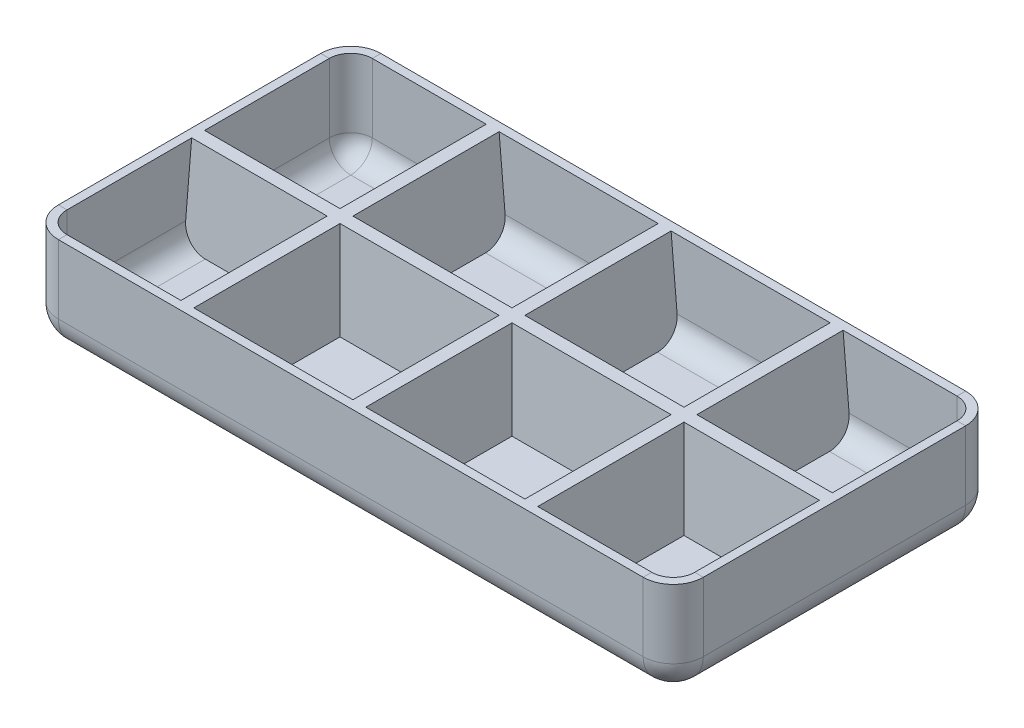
ISO-10303-21;
HEADER;
FILE_DESCRIPTION(('STEP AP214'),'2;1');
FILE_NAME('part.step','',(''),(''),'','','');
FILE_SCHEMA(('AUTOMOTIVE_DESIGN { 1 0 10303 214 1 1 1 1 }'));
ENDSEC;
DATA;
#1=APPLICATION_CONTEXT('core data for automotive mechanical design processes');
#2=APPLICATION_PROTOCOL_DEFINITION('international standard','automotive_design',2000,#1);
#3=PRODUCT_CONTEXT('',#1,'mechanical');
#4=PRODUCT('Part','Part','',(#3));
#5=PRODUCT_RELATED_PRODUCT_CATEGORY('part','',(#4));
#6=PRODUCT_DEFINITION_FORMATION('','',#4);
#7=PRODUCT_DEFINITION_CONTEXT('part definition',#1,'design');
#8=PRODUCT_DEFINITION('design','',#6,#7);
#9=PRODUCT_DEFINITION_SHAPE('','',#8);
#10=(LENGTH_UNIT() NAMED_UNIT(*) SI_UNIT(.MILLI.,.METRE.));
#11=(NAMED_UNIT(*) PLANE_ANGLE_UNIT() SI_UNIT($,.RADIAN.));
#12=(NAMED_UNIT(*) SI_UNIT($,.STERADIAN.) SOLID_ANGLE_UNIT());
#13=UNCERTAINTY_MEASURE_WITH_UNIT(LENGTH_MEASURE(1.E-05),#10,'distance_accuracy_value','');
#14=(GEOMETRIC_REPRESENTATION_CONTEXT(3) GLOBAL_UNCERTAINTY_ASSIGNED_CONTEXT((#13)) GLOBAL_UNIT_ASSIGNED_CONTEXT((#10,
#11,#12)) REPRESENTATION_CONTEXT('',''));
#15=CARTESIAN_POINT('',(0.,0.,0.));
#16=DIRECTION('',(0.,0.,1.));
#17=DIRECTION('',(1.,0.,0.));
#18=AXIS2_PLACEMENT_3D('',#15,#16,#17);
#19=CARTESIAN_POINT('',(0.,2.,-75.));
#20=DIRECTION('',(0.,-1.,0.));
#21=DIRECTION('',(0.,0.,-1.));
#22=AXIS2_PLACEMENT_3D('',#19,#20,#21);
#23=PLANE('',#22);
#24=DIRECTION('',(0.,0.,1.));
#25=VECTOR('',#24,1.);
#26=CARTESIAN_POINT('',(31.6627380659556,2.,-75.));
#27=LINE('',#26,#25);
#28=CARTESIAN_POINT('',(31.6627380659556,2.,-34.1627380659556));
#29=VERTEX_POINT('',#28);
#30=CARTESIAN_POINT('',(31.6627380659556,2.,-7.00000000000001));
#31=VERTEX_POINT('',#30);
#32=EDGE_CURVE('E710',#29,#31,#27,.T.);
#33=ORIENTED_EDGE('',*,*,#32,.F.);
#34=DIRECTION('',(1.,0.,0.));
#35=VECTOR('',#34,1.);
#36=CARTESIAN_POINT('',(0.,2.,-34.1627380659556));
#37=LINE('',#36,#35);
#38=CARTESIAN_POINT('',(7.,2.,-34.1627380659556));
#39=VERTEX_POINT('',#38);
#40=EDGE_CURVE('E628',#39,#29,#37,.T.);
#41=ORIENTED_EDGE('',*,*,#40,.F.);
#42=DIRECTION('',(0.,0.,-1.));
#43=VECTOR('',#42,1.);
#44=CARTESIAN_POINT('',(7.,2.,-75.));
#45=LINE('',#44,#43);
#46=CARTESIAN_POINT('',(7.,2.,-7.));
#47=VERTEX_POINT('',#46);
#48=EDGE_CURVE('E503',#47,#39,#45,.T.);
#49=ORIENTED_EDGE('',*,*,#48,.F.);
#50=DIRECTION('',(1.,0.,0.));
#51=VECTOR('',#50,1.);
#52=CARTESIAN_POINT('',(0.,2.,-7.00000000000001));
#53=LINE('',#52,#51);
#54=EDGE_CURVE('E438',#31,#47,#53,.F.);
#55=ORIENTED_EDGE('',*,*,#54,.F.);
#56=EDGE_LOOP('',(#33,#41,#49,#55));
#57=FACE_BOUND('',#56,.T.);
#58=ADVANCED_FACE('F33',(#57),#23,.F.);
#59=CARTESIAN_POINT('',(0.,30.,-2.));
#60=DIRECTION('',(0.,0.,-1.));
#61=DIRECTION('',(-1.,0.,0.));
#62=AXIS2_PLACEMENT_3D('',#59,#60,#61);
#63=PLANE('',#62);
#64=DIRECTION('',(-1.,0.,0.));
#65=VECTOR('',#64,1.);
#66=CARTESIAN_POINT('',(0.,23.,-2.));
#67=LINE('',#66,#65);
#68=CARTESIAN_POINT('',(33.5,23.,-2.));
#69=VERTEX_POINT('',#68);
#70=CARTESIAN_POINT('',(7.,23.,-2.));
#71=VERTEX_POINT('',#70);
#72=EDGE_CURVE('E452',#69,#71,#67,.T.);
#73=ORIENTED_EDGE('',*,*,#72,.F.);
#74=DIRECTION('',(-0.0871557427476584,-0.996194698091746,0.));
#75=VECTOR('',#74,1.);
#76=CARTESIAN_POINT('',(33.8532984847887,27.0382201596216,-2.));
#77=LINE('',#76,#75);
#78=CARTESIAN_POINT('',(32.1001813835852,7.,-2.));
#79=VERTEX_POINT('',#78);
#80=EDGE_CURVE('E705',#69,#79,#77,.T.);
#81=ORIENTED_EDGE('',*,*,#80,.T.);
#82=DIRECTION('',(-1.,0.,0.));
#83=VECTOR('',#82,1.);
#84=CARTESIAN_POINT('',(0.,7.,-2.));
#85=LINE('',#84,#83);
#86=CARTESIAN_POINT('',(7.,7.,-2.));
#87=VERTEX_POINT('',#86);
#88=EDGE_CURVE('E480',#87,#79,#85,.F.);
#89=ORIENTED_EDGE('',*,*,#88,.F.);
#90=DIRECTION('',(0.,1.,0.));
#91=VECTOR('',#90,1.);
#92=CARTESIAN_POINT('',(7.,30.,-2.));
#93=LINE('',#92,#91);
#94=EDGE_CURVE('E486',#71,#87,#93,.F.);
#95=ORIENTED_EDGE('',*,*,#94,.F.);
#96=EDGE_LOOP('',(#73,#81,#89,#95));
#97=FACE_BOUND('',#96,.T.);
#98=ADVANCED_FACE('F722',(#97),#63,.T.);
#99=CARTESIAN_POINT('',(0.,30.,-73.));
#100=DIRECTION('',(0.,0.,1.));
#101=DIRECTION('',(1.,0.,0.));
#102=AXIS2_PLACEMENT_3D('',#99,#100,#101);
#103=PLANE('',#102);
#104=DIRECTION('',(1.,0.,0.));
#105=VECTOR('',#104,1.);
#106=CARTESIAN_POINT('',(0.,7.,-73.));
#107=LINE('',#106,#105);
#108=CARTESIAN_POINT('',(32.1001813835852,7.,-73.));
#109=VERTEX_POINT('',#108);
#110=CARTESIAN_POINT('',(7.,7.,-73.));
#111=VERTEX_POINT('',#110);
#112=EDGE_CURVE('E403',#109,#111,#107,.F.);
#113=ORIENTED_EDGE('',*,*,#112,.F.);
#114=DIRECTION('',(0.0871557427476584,0.996194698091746,0.));
#115=VECTOR('',#114,1.);
#116=CARTESIAN_POINT('',(33.8532984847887,27.0382201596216,-73.));
#117=LINE('',#116,#115);
#118=CARTESIAN_POINT('',(33.5,23.,-73.));
#119=VERTEX_POINT('',#118);
#120=EDGE_CURVE('E386',#109,#119,#117,.T.);
#121=ORIENTED_EDGE('',*,*,#120,.T.);
#122=DIRECTION('',(1.,0.,0.));
#123=VECTOR('',#122,1.);
#124=CARTESIAN_POINT('',(0.,23.,-73.));
#125=LINE('',#124,#123);
#126=CARTESIAN_POINT('',(7.,23.,-73.));
#127=VERTEX_POINT('',#126);
#128=EDGE_CURVE('E401',#127,#119,#125,.T.);
#129=ORIENTED_EDGE('',*,*,#128,.F.);
#130=DIRECTION('',(0.,1.,0.));
#131=VECTOR('',#130,1.);
#132=CARTESIAN_POINT('',(7.,30.,-73.));
#133=LINE('',#132,#131);
#134=EDGE_CURVE('E532',#111,#127,#133,.T.);
#135=ORIENTED_EDGE('',*,*,#134,.F.);
#136=EDGE_LOOP('',(#113,#121,#129,#135));
#137=FACE_BOUND('',#136,.T.);
#138=ADVANCED_FACE('F399',(#137),#103,.T.);
#139=DIRECTION('',(0.,0.,1.));
#140=VECTOR('',#139,1.);
#141=CARTESIAN_POINT('',(31.6627380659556,2.,-75.));
#142=LINE('',#141,#140);
#143=CARTESIAN_POINT('',(31.6627380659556,2.,-68.));
#144=VERTEX_POINT('',#143);
#145=CARTESIAN_POINT('',(31.6627380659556,2.,-40.8372619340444));
#146=VERTEX_POINT('',#145);
#147=EDGE_CURVE('E48',#144,#146,#142,.T.);
#148=ORIENTED_EDGE('',*,*,#147,.F.);
#149=DIRECTION('',(1.,0.,0.));
#150=VECTOR('',#149,1.);
#151=CARTESIAN_POINT('',(0.,2.,-68.));
#152=LINE('',#151,#150);
#153=CARTESIAN_POINT('',(7.,2.,-68.));
#154=VERTEX_POINT('',#153);
#155=EDGE_CURVE('E497',#154,#144,#152,.T.);
#156=ORIENTED_EDGE('',*,*,#155,.F.);
#157=CARTESIAN_POINT('',(7.,2.,-40.8372619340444));
#158=VERTEX_POINT('',#157);
#159=EDGE_CURVE('E506',#158,#154,#45,.T.);
#160=ORIENTED_EDGE('',*,*,#159,.F.);
#161=DIRECTION('',(-1.,0.,0.));
#162=VECTOR('',#161,1.);
#163=CARTESIAN_POINT('',(0.,2.,-40.8372619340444));
#164=LINE('',#163,#162);
#165=EDGE_CURVE('E608',#158,#146,#164,.F.);
#166=ORIENTED_EDGE('',*,*,#165,.T.);
#167=EDGE_LOOP('',(#148,#156,#160,#166));
#168=FACE_BOUND('',#167,.T.);
#169=ADVANCED_FACE('F911',(#168),#23,.F.);
#170=CARTESIAN_POINT('',(0.,7.,-68.));
#171=DIRECTION('',(1.,0.,0.));
#172=DIRECTION('',(0.,0.,-1.));
#173=AXIS2_PLACEMENT_3D('',#170,#171,#172);
#174=CYLINDRICAL_SURFACE('',#173,5.);
#175=CARTESIAN_POINT('',(32.1001813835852,7.,-68.));
#176=DIRECTION('',(0.996194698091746,-0.0871557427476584,0.));
#177=DIRECTION('',(0.0871557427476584,0.996194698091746,0.));
#178=AXIS2_PLACEMENT_3D('',#175,#176,#177);
#179=ELLIPSE('',#178,5.01909918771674,5.);
#180=EDGE_CURVE('E404',#109,#144,#179,.F.);
#181=ORIENTED_EDGE('',*,*,#180,.F.);
#182=ORIENTED_EDGE('',*,*,#112,.T.);
#183=CARTESIAN_POINT('',(7.,7.,-68.));
#184=DIRECTION('',(-1.,0.,0.));
#185=DIRECTION('',(0.,-1.,0.));
#186=AXIS2_PLACEMENT_3D('',#183,#184,#185);
#187=CIRCLE('',#186,5.);
#188=EDGE_CURVE('E464',#111,#154,#187,.T.);
#189=ORIENTED_EDGE('',*,*,#188,.T.);
#190=ORIENTED_EDGE('',*,*,#155,.T.);
#191=EDGE_LOOP('',(#181,#182,#189,#190));
#192=FACE_BOUND('',#191,.T.);
#193=ADVANCED_FACE('F915',(#192),#174,.F.);
#194=CARTESIAN_POINT('',(0.,7.,-7.));
#195=DIRECTION('',(-1.,0.,0.));
#196=DIRECTION('',(0.,0.,1.));
#197=AXIS2_PLACEMENT_3D('',#194,#195,#196);
#198=CYLINDRICAL_SURFACE('',#197,5.);
#199=CARTESIAN_POINT('',(32.1001813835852,7.,-7.));
#200=DIRECTION('',(0.996194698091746,-0.0871557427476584,0.));
#201=DIRECTION('',(-0.0871557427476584,-0.996194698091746,0.));
#202=AXIS2_PLACEMENT_3D('',#199,#200,#201);
#203=ELLIPSE('',#202,5.01909918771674,5.);
#204=EDGE_CURVE('E708',#31,#79,#203,.F.);
#205=ORIENTED_EDGE('',*,*,#204,.F.);
#206=ORIENTED_EDGE('',*,*,#54,.T.);
#207=CARTESIAN_POINT('',(7.,7.,-7.));
#208=DIRECTION('',(-1.,0.,0.));
#209=DIRECTION('',(0.,-1.,0.));
#210=AXIS2_PLACEMENT_3D('',#207,#208,#209);
#211=CIRCLE('',#210,5.);
#212=EDGE_CURVE('E471',#47,#87,#211,.T.);
#213=ORIENTED_EDGE('',*,*,#212,.T.);
#214=ORIENTED_EDGE('',*,*,#88,.T.);
#215=EDGE_LOOP('',(#205,#206,#213,#214));
#216=FACE_BOUND('',#215,.T.);
#217=ADVANCED_FACE('F925',(#216),#198,.F.);
#218=CARTESIAN_POINT('',(0.,23.,-39.));
#219=DIRECTION('',(0.,-0.0871557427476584,0.996194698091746));
#220=DIRECTION('',(0.,-0.996194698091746,-0.0871557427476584));
#221=AXIS2_PLACEMENT_3D('',#218,#219,#220);
#222=PLANE('',#221);
#223=DIRECTION('',(-1.,0.,0.));
#224=VECTOR('',#223,1.);
#225=CARTESIAN_POINT('',(0.,23.,-39.));
#226=LINE('',#225,#224);
#227=CARTESIAN_POINT('',(2.,23.,-39.));
#228=VERTEX_POINT('',#227);
#229=CARTESIAN_POINT('',(33.5,23.,-39.));
#230=VERTEX_POINT('',#229);
#231=EDGE_CURVE('E637',#228,#230,#226,.F.);
#232=ORIENTED_EDGE('',*,*,#231,.T.);
#233=DIRECTION('',(0.0868265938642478,0.992432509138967,0.0868265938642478));
#234=VECTOR('',#233,1.);
#235=CARTESIAN_POINT('',(33.2474482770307,20.113320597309,-39.2525517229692));
#236=LINE('',#235,#234);
#237=EDGE_CURVE('E388',#230,#146,#236,.F.);
#238=ORIENTED_EDGE('',*,*,#237,.T.);
#239=ORIENTED_EDGE('',*,*,#165,.F.);
#240=CARTESIAN_POINT('',(7.,7.,-40.3998186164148));
#241=DIRECTION('',(0.,-0.0871557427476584,0.996194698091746));
#242=DIRECTION('',(0.,-0.996194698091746,-0.0871557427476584));
#243=AXIS2_PLACEMENT_3D('',#240,#241,#242);
#244=ELLIPSE('',#243,5.01909918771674,5.);
#245=CARTESIAN_POINT('',(2.,7.,-40.3998186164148));
#246=VERTEX_POINT('',#245);
#247=EDGE_CURVE('E606',#246,#158,#244,.T.);
#248=ORIENTED_EDGE('',*,*,#247,.F.);
#249=DIRECTION('',(0.,-0.996194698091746,-0.0871557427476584));
#250=VECTOR('',#249,1.);
#251=CARTESIAN_POINT('',(2.,33.3329666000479,-38.0959825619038));
#252=LINE('',#251,#250);
#253=EDGE_CURVE('E603',#246,#228,#252,.F.);
#254=ORIENTED_EDGE('',*,*,#253,.T.);
#255=EDGE_LOOP('',(#232,#238,#239,#248,#254));
#256=FACE_BOUND('',#255,.T.);
#257=ADVANCED_FACE('F909',(#256),#222,.F.);
#258=CARTESIAN_POINT('',(0.,23.,-36.));
#259=DIRECTION('',(0.,-0.0871557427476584,-0.996194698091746));
#260=DIRECTION('',(0.,0.996194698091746,-0.0871557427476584));
#261=AXIS2_PLACEMENT_3D('',#258,#259,#260);
#262=PLANE('',#261);
#263=DIRECTION('',(-0.0868265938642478,-0.992432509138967,0.0868265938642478));
#264=VECTOR('',#263,1.);
#265=CARTESIAN_POINT('',(33.2474482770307,20.113320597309,-35.7474482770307));
#266=LINE('',#265,#264);
#267=CARTESIAN_POINT('',(33.5,23.,-36.));
#268=VERTEX_POINT('',#267);
#269=EDGE_CURVE('E37',#268,#29,#266,.T.);
#270=ORIENTED_EDGE('',*,*,#269,.F.);
#271=DIRECTION('',(-1.,0.,0.));
#272=VECTOR('',#271,1.);
#273=CARTESIAN_POINT('',(0.,23.,-36.));
#274=LINE('',#273,#272);
#275=CARTESIAN_POINT('',(2.,23.,-36.));
#276=VERTEX_POINT('',#275);
#277=EDGE_CURVE('E643',#276,#268,#274,.F.);
#278=ORIENTED_EDGE('',*,*,#277,.F.);
#279=DIRECTION('',(0.,0.996194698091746,-0.0871557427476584));
#280=VECTOR('',#279,1.);
#281=CARTESIAN_POINT('',(2.,26.821159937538,-36.334308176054));
#282=LINE('',#281,#280);
#283=CARTESIAN_POINT('',(2.,7.,-34.6001813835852));
#284=VERTEX_POINT('',#283);
#285=EDGE_CURVE('E623',#284,#276,#282,.T.);
#286=ORIENTED_EDGE('',*,*,#285,.F.);
#287=CARTESIAN_POINT('',(7.,7.,-34.6001813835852));
#288=DIRECTION('',(0.,-0.0871557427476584,-0.996194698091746));
#289=DIRECTION('',(0.,0.996194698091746,-0.0871557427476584));
#290=AXIS2_PLACEMENT_3D('',#287,#288,#289);
#291=ELLIPSE('',#290,5.01909918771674,5.);
#292=EDGE_CURVE('E625',#284,#39,#291,.F.);
#293=ORIENTED_EDGE('',*,*,#292,.T.);
#294=ORIENTED_EDGE('',*,*,#40,.T.);
#295=EDGE_LOOP('',(#270,#278,#286,#293,#294));
#296=FACE_BOUND('',#295,.T.);
#297=ADVANCED_FACE('F996',(#296),#262,.F.);
#298=DIRECTION('',(0.,0.,1.));
#299=VECTOR('',#298,1.);
#300=CARTESIAN_POINT('',(111.662738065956,2.,-75.));
#301=LINE('',#300,#299);
#302=CARTESIAN_POINT('',(111.662738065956,2.,-34.1627380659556));
#303=VERTEX_POINT('',#302);
#304=CARTESIAN_POINT('',(111.662738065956,2.,-7.00000000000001));
#305=VERTEX_POINT('',#304);
#306=EDGE_CURVE('E677',#303,#305,#301,.T.);
#307=ORIENTED_EDGE('',*,*,#306,.F.);
#308=DIRECTION('',(1.,0.,0.));
#309=VECTOR('',#308,1.);
#310=CARTESIAN_POINT('',(0.,2.,-34.1627380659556));
#311=LINE('',#310,#309);
#312=CARTESIAN_POINT('',(78.3372619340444,2.,-34.1627380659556));
#313=VERTEX_POINT('',#312);
#314=EDGE_CURVE('E617',#313,#303,#311,.T.);
#315=ORIENTED_EDGE('',*,*,#314,.F.);
#316=DIRECTION('',(0.,0.,-1.));
#317=VECTOR('',#316,1.);
#318=CARTESIAN_POINT('',(78.3372619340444,2.,-75.));
#319=LINE('',#318,#317);
#320=CARTESIAN_POINT('',(78.3372619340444,2.,-7.00000000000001));
#321=VERTEX_POINT('',#320);
#322=EDGE_CURVE('E570',#313,#321,#319,.F.);
#323=ORIENTED_EDGE('',*,*,#322,.T.);
#324=EDGE_CURVE('E436',#305,#321,#53,.F.);
#325=ORIENTED_EDGE('',*,*,#324,.F.);
#326=EDGE_LOOP('',(#307,#315,#323,#325));
#327=FACE_BOUND('',#326,.T.);
#328=ADVANCED_FACE('F940',(#327),#23,.F.);
#329=CARTESIAN_POINT('',(113.5,23.,-2.));
#330=VERTEX_POINT('',#329);
#331=CARTESIAN_POINT('',(76.5,23.,-2.));
#332=VERTEX_POINT('',#331);
#333=EDGE_CURVE('E451',#330,#332,#67,.T.);
#334=ORIENTED_EDGE('',*,*,#333,.F.);
#335=DIRECTION('',(-0.0871557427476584,-0.996194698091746,0.));
#336=VECTOR('',#335,1.);
#337=CARTESIAN_POINT('',(113.245608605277,20.0922930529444,-2.));
#338=LINE('',#337,#336);
#339=CARTESIAN_POINT('',(112.100181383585,7.,-2.));
#340=VERTEX_POINT('',#339);
#341=EDGE_CURVE('E672',#330,#340,#338,.T.);
#342=ORIENTED_EDGE('',*,*,#341,.T.);
#343=CARTESIAN_POINT('',(77.8998186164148,7.,-2.));
#344=VERTEX_POINT('',#343);
#345=EDGE_CURVE('E485',#344,#340,#85,.F.);
#346=ORIENTED_EDGE('',*,*,#345,.F.);
#347=DIRECTION('',(-0.0871557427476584,0.996194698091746,0.));
#348=VECTOR('',#347,1.);
#349=CARTESIAN_POINT('',(75.3111279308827,36.5888699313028,-2.));
#350=LINE('',#349,#348);
#351=EDGE_CURVE('E565',#332,#344,#350,.F.);
#352=ORIENTED_EDGE('',*,*,#351,.F.);
#353=EDGE_LOOP('',(#334,#342,#346,#352));
#354=FACE_BOUND('',#353,.T.);
#355=ADVANCED_FACE('F739',(#354),#63,.T.);
#356=CARTESIAN_POINT('',(112.100181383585,7.,-73.));
#357=VERTEX_POINT('',#356);
#358=CARTESIAN_POINT('',(77.8998186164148,7.,-73.));
#359=VERTEX_POINT('',#358);
#360=EDGE_CURVE('E533',#357,#359,#107,.F.);
#361=ORIENTED_EDGE('',*,*,#360,.F.);
#362=DIRECTION('',(0.0871557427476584,0.996194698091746,0.));
#363=VECTOR('',#362,1.);
#364=CARTESIAN_POINT('',(113.245608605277,20.0922930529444,-73.));
#365=LINE('',#364,#363);
#366=CARTESIAN_POINT('',(113.5,23.,-73.));
#367=VERTEX_POINT('',#366);
#368=EDGE_CURVE('E662',#357,#367,#365,.T.);
#369=ORIENTED_EDGE('',*,*,#368,.T.);
#370=CARTESIAN_POINT('',(76.5,23.,-73.));
#371=VERTEX_POINT('',#370);
#372=EDGE_CURVE('E414',#371,#367,#125,.T.);
#373=ORIENTED_EDGE('',*,*,#372,.F.);
#374=DIRECTION('',(0.0871557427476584,-0.996194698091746,0.));
#375=VECTOR('',#374,1.);
#376=CARTESIAN_POINT('',(75.3111279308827,36.5888699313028,-73.));
#377=LINE('',#376,#375);
#378=EDGE_CURVE('E463',#359,#371,#377,.F.);
#379=ORIENTED_EDGE('',*,*,#378,.F.);
#380=EDGE_LOOP('',(#361,#369,#373,#379));
#381=FACE_BOUND('',#380,.T.);
#382=ADVANCED_FACE('F968',(#381),#103,.T.);
#383=DIRECTION('',(0.,0.,1.));
#384=VECTOR('',#383,1.);
#385=CARTESIAN_POINT('',(111.662738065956,2.,-75.));
#386=LINE('',#385,#384);
#387=CARTESIAN_POINT('',(111.662738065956,2.,-68.));
#388=VERTEX_POINT('',#387);
#389=CARTESIAN_POINT('',(111.662738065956,2.,-40.8372619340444));
#390=VERTEX_POINT('',#389);
#391=EDGE_CURVE('E667',#388,#390,#386,.T.);
#392=ORIENTED_EDGE('',*,*,#391,.F.);
#393=CARTESIAN_POINT('',(78.3372619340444,2.,-68.));
#394=VERTEX_POINT('',#393);
#395=EDGE_CURVE('E502',#394,#388,#152,.T.);
#396=ORIENTED_EDGE('',*,*,#395,.F.);
#397=CARTESIAN_POINT('',(78.3372619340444,2.,-40.8372619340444));
#398=VERTEX_POINT('',#397);
#399=EDGE_CURVE('E567',#394,#398,#319,.F.);
#400=ORIENTED_EDGE('',*,*,#399,.T.);
#401=DIRECTION('',(-1.,0.,0.));
#402=VECTOR('',#401,1.);
#403=CARTESIAN_POINT('',(0.,2.,-40.8372619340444));
#404=LINE('',#403,#402);
#405=EDGE_CURVE('E596',#398,#390,#404,.F.);
#406=ORIENTED_EDGE('',*,*,#405,.T.);
#407=EDGE_LOOP('',(#392,#396,#400,#406));
#408=FACE_BOUND('',#407,.T.);
#409=ADVANCED_FACE('F986',(#408),#23,.F.);
#410=CARTESIAN_POINT('',(112.100181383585,7.,-68.));
#411=DIRECTION('',(0.996194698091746,-0.0871557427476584,0.));
#412=DIRECTION('',(0.0871557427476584,0.996194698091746,0.));
#413=AXIS2_PLACEMENT_3D('',#410,#411,#412);
#414=ELLIPSE('',#413,5.01909918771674,5.);
#415=EDGE_CURVE('E665',#357,#388,#414,.F.);
#416=ORIENTED_EDGE('',*,*,#415,.F.);
#417=ORIENTED_EDGE('',*,*,#360,.T.);
#418=CARTESIAN_POINT('',(77.8998186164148,7.,-68.));
#419=DIRECTION('',(-0.996194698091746,-0.0871557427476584,0.));
#420=DIRECTION('',(0.0871557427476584,-0.996194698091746,0.));
#421=AXIS2_PLACEMENT_3D('',#418,#419,#420);
#422=ELLIPSE('',#421,5.01909918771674,5.);
#423=EDGE_CURVE('E562',#359,#394,#422,.T.);
#424=ORIENTED_EDGE('',*,*,#423,.T.);
#425=ORIENTED_EDGE('',*,*,#395,.T.);
#426=EDGE_LOOP('',(#416,#417,#424,#425));
#427=FACE_BOUND('',#426,.T.);
#428=ADVANCED_FACE('F965',(#427),#174,.F.);
#429=CARTESIAN_POINT('',(112.100181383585,7.,-7.));
#430=DIRECTION('',(0.996194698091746,-0.0871557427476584,0.));
#431=DIRECTION('',(-0.0871557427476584,-0.996194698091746,0.));
#432=AXIS2_PLACEMENT_3D('',#429,#430,#431);
#433=ELLIPSE('',#432,5.01909918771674,5.);
#434=EDGE_CURVE('E675',#305,#340,#433,.F.);
#435=ORIENTED_EDGE('',*,*,#434,.F.);
#436=ORIENTED_EDGE('',*,*,#324,.T.);
#437=CARTESIAN_POINT('',(77.8998186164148,7.,-7.));
#438=DIRECTION('',(-0.996194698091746,-0.0871557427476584,0.));
#439=DIRECTION('',(-0.0871557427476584,0.996194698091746,0.));
#440=AXIS2_PLACEMENT_3D('',#437,#438,#439);
#441=ELLIPSE('',#440,5.01909918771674,5.);
#442=EDGE_CURVE('E786',#321,#344,#441,.T.);
#443=ORIENTED_EDGE('',*,*,#442,.T.);
#444=ORIENTED_EDGE('',*,*,#345,.T.);
#445=EDGE_LOOP('',(#435,#436,#443,#444));
#446=FACE_BOUND('',#445,.T.);
#447=ADVANCED_FACE('F1004',(#446),#198,.F.);
#448=CARTESIAN_POINT('',(76.5,23.,-39.));
#449=VERTEX_POINT('',#448);
#450=CARTESIAN_POINT('',(113.5,23.,-39.));
#451=VERTEX_POINT('',#450);
#452=EDGE_CURVE('E632',#449,#451,#226,.F.);
#453=ORIENTED_EDGE('',*,*,#452,.T.);
#454=DIRECTION('',(0.0868265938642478,0.992432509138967,0.0868265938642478));
#455=VECTOR('',#454,1.);
#456=CARTESIAN_POINT('',(112.644339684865,13.2197578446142,-39.8556603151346));
#457=LINE('',#456,#455);
#458=EDGE_CURVE('E669',#451,#390,#457,.F.);
#459=ORIENTED_EDGE('',*,*,#458,.T.);
#460=ORIENTED_EDGE('',*,*,#405,.F.);
#461=DIRECTION('',(-0.0868265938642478,0.992432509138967,0.0868265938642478));
#462=VECTOR('',#461,1.);
#463=CARTESIAN_POINT('',(76.7713988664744,19.8978967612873,-39.2713988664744));
#464=LINE('',#463,#462);
#465=EDGE_CURVE('E600',#398,#449,#464,.T.);
#466=ORIENTED_EDGE('',*,*,#465,.T.);
#467=EDGE_LOOP('',(#453,#459,#460,#466));
#468=FACE_BOUND('',#467,.T.);
#469=ADVANCED_FACE('F993',(#468),#222,.F.);
#470=DIRECTION('',(-0.0868265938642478,-0.992432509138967,0.0868265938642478));
#471=VECTOR('',#470,1.);
#472=CARTESIAN_POINT('',(112.644339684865,13.2197578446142,-35.1443396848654));
#473=LINE('',#472,#471);
#474=CARTESIAN_POINT('',(113.5,23.,-36.));
#475=VERTEX_POINT('',#474);
#476=EDGE_CURVE('E778',#475,#303,#473,.T.);
#477=ORIENTED_EDGE('',*,*,#476,.F.);
#478=CARTESIAN_POINT('',(76.5,23.,-36.));
#479=VERTEX_POINT('',#478);
#480=EDGE_CURVE('E638',#479,#475,#274,.F.);
#481=ORIENTED_EDGE('',*,*,#480,.F.);
#482=DIRECTION('',(0.0868265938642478,-0.992432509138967,0.0868265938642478));
#483=VECTOR('',#482,1.);
#484=CARTESIAN_POINT('',(76.2059845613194,26.3606118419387,-36.2940154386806));
#485=LINE('',#484,#483);
#486=EDGE_CURVE('E621',#313,#479,#485,.F.);
#487=ORIENTED_EDGE('',*,*,#486,.F.);
#488=ORIENTED_EDGE('',*,*,#314,.T.);
#489=EDGE_LOOP('',(#477,#481,#487,#488));
#490=FACE_BOUND('',#489,.T.);
#491=ADVANCED_FACE('F984',(#490),#262,.F.);
#492=CARTESIAN_POINT('',(38.3372619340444,2.,-34.1627380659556));
#493=VERTEX_POINT('',#492);
#494=CARTESIAN_POINT('',(71.6627380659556,2.,-34.1627380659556));
#495=VERTEX_POINT('',#494);
#496=EDGE_CURVE('E631',#493,#495,#37,.T.);
#497=ORIENTED_EDGE('',*,*,#496,.F.);
#498=DIRECTION('',(0.,0.,-1.));
#499=VECTOR('',#498,1.);
#500=CARTESIAN_POINT('',(38.3372619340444,2.,-75.));
#501=LINE('',#500,#499);
#502=CARTESIAN_POINT('',(38.3372619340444,2.,-7.00000000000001));
#503=VERTEX_POINT('',#502);
#504=EDGE_CURVE('E56',#493,#503,#501,.F.);
#505=ORIENTED_EDGE('',*,*,#504,.T.);
#506=CARTESIAN_POINT('',(71.6627380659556,2.,-7.00000000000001));
#507=VERTEX_POINT('',#506);
#508=EDGE_CURVE('E439',#507,#503,#53,.F.);
#509=ORIENTED_EDGE('',*,*,#508,.F.);
#510=DIRECTION('',(0.,0.,1.));
#511=VECTOR('',#510,1.);
#512=CARTESIAN_POINT('',(71.6627380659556,2.,-75.));
#513=LINE('',#512,#511);
#514=EDGE_CURVE('E583',#495,#507,#513,.T.);
#515=ORIENTED_EDGE('',*,*,#514,.F.);
#516=EDGE_LOOP('',(#497,#505,#509,#515));
#517=FACE_BOUND('',#516,.T.);
#518=ADVANCED_FACE('F972',(#517),#23,.F.);
#519=CARTESIAN_POINT('',(2.,30.,0.));
#520=DIRECTION('',(1.,0.,0.));
#521=DIRECTION('',(0.,0.,-1.));
#522=AXIS2_PLACEMENT_3D('',#519,#520,#521);
#523=PLANE('',#522);
#524=DIRECTION('',(0.,0.,-1.));
#525=VECTOR('',#524,1.);
#526=CARTESIAN_POINT('',(2.,7.,0.));
#527=LINE('',#526,#525);
#528=CARTESIAN_POINT('',(2.,7.,-7.));
#529=VERTEX_POINT('',#528);
#530=EDGE_CURVE('E489',#284,#529,#527,.F.);
#531=ORIENTED_EDGE('',*,*,#530,.F.);
#532=ORIENTED_EDGE('',*,*,#285,.T.);
#533=DIRECTION('',(0.,0.,-1.));
#534=VECTOR('',#533,1.);
#535=CARTESIAN_POINT('',(2.,23.,0.));
#536=LINE('',#535,#534);
#537=CARTESIAN_POINT('',(2.,23.,-7.));
#538=VERTEX_POINT('',#537);
#539=EDGE_CURVE('E457',#538,#276,#536,.T.);
#540=ORIENTED_EDGE('',*,*,#539,.F.);
#541=DIRECTION('',(0.,1.,0.));
#542=VECTOR('',#541,1.);
#543=CARTESIAN_POINT('',(2.,30.,-7.));
#544=LINE('',#543,#542);
#545=EDGE_CURVE('E545',#529,#538,#544,.T.);
#546=ORIENTED_EDGE('',*,*,#545,.F.);
#547=EDGE_LOOP('',(#531,#532,#540,#546));
#548=FACE_BOUND('',#547,.T.);
#549=ADVANCED_FACE('F980',(#548),#523,.T.);
#550=CARTESIAN_POINT('',(148.,30.,0.));
#551=DIRECTION('',(-1.,0.,0.));
#552=DIRECTION('',(0.,0.,1.));
#553=AXIS2_PLACEMENT_3D('',#550,#551,#552);
#554=PLANE('',#553);
#555=DIRECTION('',(0.,0.,1.));
#556=VECTOR('',#555,1.);
#557=CARTESIAN_POINT('',(148.,23.,0.));
#558=LINE('',#557,#556);
#559=CARTESIAN_POINT('',(148.,23.,-36.));
#560=VERTEX_POINT('',#559);
#561=CARTESIAN_POINT('',(148.,23.,-7.));
#562=VERTEX_POINT('',#561);
#563=EDGE_CURVE('E411',#560,#562,#558,.T.);
#564=ORIENTED_EDGE('',*,*,#563,.F.);
#565=DIRECTION('',(0.,-0.996194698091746,0.0871557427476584));
#566=VECTOR('',#565,1.);
#567=CARTESIAN_POINT('',(148.,26.821159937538,-36.334308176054));
#568=LINE('',#567,#566);
#569=CARTESIAN_POINT('',(148.,7.,-34.6001813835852));
#570=VERTEX_POINT('',#569);
#571=EDGE_CURVE('E612',#560,#570,#568,.T.);
#572=ORIENTED_EDGE('',*,*,#571,.T.);
#573=DIRECTION('',(0.,0.,1.));
#574=VECTOR('',#573,1.);
#575=CARTESIAN_POINT('',(148.,7.,0.));
#576=LINE('',#575,#574);
#577=CARTESIAN_POINT('',(148.,7.,-7.));
#578=VERTEX_POINT('',#577);
#579=EDGE_CURVE('E517',#578,#570,#576,.F.);
#580=ORIENTED_EDGE('',*,*,#579,.F.);
#581=DIRECTION('',(0.,1.,0.));
#582=VECTOR('',#581,1.);
#583=CARTESIAN_POINT('',(148.,30.,-7.));
#584=LINE('',#583,#582);
#585=EDGE_CURVE('E522',#562,#578,#584,.F.);
#586=ORIENTED_EDGE('',*,*,#585,.F.);
#587=EDGE_LOOP('',(#564,#572,#580,#586));
#588=FACE_BOUND('',#587,.T.);
#589=ADVANCED_FACE('F971',(#588),#554,.T.);
#590=CARTESIAN_POINT('',(118.337261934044,2.,-34.1627380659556));
#591=VERTEX_POINT('',#590);
#592=CARTESIAN_POINT('',(143.,2.,-34.1627380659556));
#593=VERTEX_POINT('',#592);
#594=EDGE_CURVE('E620',#591,#593,#311,.T.);
#595=ORIENTED_EDGE('',*,*,#594,.F.);
#596=DIRECTION('',(0.,0.,-1.));
#597=VECTOR('',#596,1.);
#598=CARTESIAN_POINT('',(118.337261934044,2.,-75.));
#599=LINE('',#598,#597);
#600=CARTESIAN_POINT('',(118.337261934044,2.,-7.00000000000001));
#601=VERTEX_POINT('',#600);
#602=EDGE_CURVE('E659',#591,#601,#599,.F.);
#603=ORIENTED_EDGE('',*,*,#602,.T.);
#604=CARTESIAN_POINT('',(143.,2.,-7.00000000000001));
#605=VERTEX_POINT('',#604);
#606=EDGE_CURVE('E429',#605,#601,#53,.F.);
#607=ORIENTED_EDGE('',*,*,#606,.F.);
#608=DIRECTION('',(0.,0.,-1.));
#609=VECTOR('',#608,1.);
#610=CARTESIAN_POINT('',(143.,2.,-75.));
#611=LINE('',#610,#609);
#612=EDGE_CURVE('E500',#593,#605,#611,.F.);
#613=ORIENTED_EDGE('',*,*,#612,.F.);
#614=EDGE_LOOP('',(#595,#603,#607,#613));
#615=FACE_BOUND('',#614,.T.);
#616=ADVANCED_FACE('F768',(#615),#23,.F.);
#617=CARTESIAN_POINT('',(143.,7.,0.));
#618=DIRECTION('',(0.,0.,1.));
#619=DIRECTION('',(1.,0.,0.));
#620=AXIS2_PLACEMENT_3D('',#617,#618,#619);
#621=CYLINDRICAL_SURFACE('',#620,5.);
#622=CARTESIAN_POINT('',(143.,7.,-34.6001813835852));
#623=DIRECTION('',(0.,-0.0871557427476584,-0.996194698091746));
#624=DIRECTION('',(0.,-0.996194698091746,0.0871557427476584));
#625=AXIS2_PLACEMENT_3D('',#622,#623,#624);
#626=ELLIPSE('',#625,5.01909918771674,5.);
#627=EDGE_CURVE('E614',#593,#570,#626,.F.);
#628=ORIENTED_EDGE('',*,*,#627,.F.);
#629=ORIENTED_EDGE('',*,*,#612,.T.);
#630=CARTESIAN_POINT('',(143.,7.,-7.));
#631=DIRECTION('',(0.,0.,1.));
#632=DIRECTION('',(1.,0.,0.));
#633=AXIS2_PLACEMENT_3D('',#630,#631,#632);
#634=CIRCLE('',#633,5.);
#635=EDGE_CURVE('E467',#605,#578,#634,.T.);
#636=ORIENTED_EDGE('',*,*,#635,.T.);
#637=ORIENTED_EDGE('',*,*,#579,.T.);
#638=EDGE_LOOP('',(#628,#629,#636,#637));
#639=FACE_BOUND('',#638,.T.);
#640=ADVANCED_FACE('F764',(#639),#621,.F.);
#641=CARTESIAN_POINT('',(7.,7.,0.));
#642=DIRECTION('',(0.,0.,-1.));
#643=DIRECTION('',(-1.,0.,0.));
#644=AXIS2_PLACEMENT_3D('',#641,#642,#643);
#645=CYLINDRICAL_SURFACE('',#644,5.);
#646=ORIENTED_EDGE('',*,*,#292,.F.);
#647=ORIENTED_EDGE('',*,*,#530,.T.);
#648=CARTESIAN_POINT('',(7.,7.,-7.));
#649=DIRECTION('',(0.,0.,1.));
#650=DIRECTION('',(1.,0.,0.));
#651=AXIS2_PLACEMENT_3D('',#648,#649,#650);
#652=CIRCLE('',#651,5.);
#653=EDGE_CURVE('E462',#529,#47,#652,.T.);
#654=ORIENTED_EDGE('',*,*,#653,.T.);
#655=ORIENTED_EDGE('',*,*,#48,.T.);
#656=EDGE_LOOP('',(#646,#647,#654,#655));
#657=FACE_BOUND('',#656,.T.);
#658=ADVANCED_FACE('F977',(#657),#645,.F.);
#659=CARTESIAN_POINT('',(76.5,23.,-75.));
#660=DIRECTION('',(-0.996194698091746,-0.0871557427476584,0.));
#661=DIRECTION('',(0.0871557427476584,-0.996194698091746,0.));
#662=AXIS2_PLACEMENT_3D('',#659,#660,#661);
#663=PLANE('',#662);
#664=ORIENTED_EDGE('',*,*,#322,.F.);
#665=ORIENTED_EDGE('',*,*,#486,.T.);
#666=DIRECTION('',(0.,0.,-1.));
#667=VECTOR('',#666,1.);
#668=CARTESIAN_POINT('',(76.5,23.,-75.));
#669=LINE('',#668,#667);
#670=EDGE_CURVE('E586',#479,#332,#669,.F.);
#671=ORIENTED_EDGE('',*,*,#670,.T.);
#672=ORIENTED_EDGE('',*,*,#351,.T.);
#673=ORIENTED_EDGE('',*,*,#442,.F.);
#674=EDGE_LOOP('',(#664,#665,#671,#672,#673));
#675=FACE_BOUND('',#674,.T.);
#676=ADVANCED_FACE('F734',(#675),#663,.F.);
#677=CARTESIAN_POINT('',(73.5,23.,-75.));
#678=DIRECTION('',(0.996194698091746,-0.0871557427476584,0.));
#679=DIRECTION('',(0.0871557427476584,0.996194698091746,0.));
#680=AXIS2_PLACEMENT_3D('',#677,#678,#679);
#681=PLANE('',#680);
#682=DIRECTION('',(0.0868265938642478,0.992432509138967,-0.0868265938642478));
#683=VECTOR('',#682,1.);
#684=CARTESIAN_POINT('',(73.7940154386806,26.3606118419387,-36.2940154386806));
#685=LINE('',#684,#683);
#686=CARTESIAN_POINT('',(73.5,23.,-36.));
#687=VERTEX_POINT('',#686);
#688=EDGE_CURVE('E783',#495,#687,#685,.T.);
#689=ORIENTED_EDGE('',*,*,#688,.F.);
#690=ORIENTED_EDGE('',*,*,#514,.T.);
#691=CARTESIAN_POINT('',(72.1001813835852,7.,-7.));
#692=DIRECTION('',(0.996194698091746,-0.0871557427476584,0.));
#693=DIRECTION('',(-0.0871557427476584,-0.996194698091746,0.));
#694=AXIS2_PLACEMENT_3D('',#691,#692,#693);
#695=ELLIPSE('',#694,5.01909918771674,5.);
#696=CARTESIAN_POINT('',(72.1001813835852,7.,-2.));
#697=VERTEX_POINT('',#696);
#698=EDGE_CURVE('E789',#507,#697,#695,.F.);
#699=ORIENTED_EDGE('',*,*,#698,.T.);
#700=DIRECTION('',(-0.0871557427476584,-0.996194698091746,0.));
#701=VECTOR('',#700,1.);
#702=CARTESIAN_POINT('',(73.5494535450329,23.565256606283,-2.));
#703=LINE('',#702,#701);
#704=CARTESIAN_POINT('',(73.5,23.,-2.));
#705=VERTEX_POINT('',#704);
#706=EDGE_CURVE('E577',#705,#697,#703,.T.);
#707=ORIENTED_EDGE('',*,*,#706,.F.);
#708=DIRECTION('',(0.,0.,-1.));
#709=VECTOR('',#708,1.);
#710=CARTESIAN_POINT('',(73.5,23.,-75.));
#711=LINE('',#710,#709);
#712=EDGE_CURVE('E590',#687,#705,#711,.F.);
#713=ORIENTED_EDGE('',*,*,#712,.F.);
#714=EDGE_LOOP('',(#689,#690,#699,#707,#713));
#715=FACE_BOUND('',#714,.T.);
#716=ADVANCED_FACE('F1070',(#715),#681,.F.);
#717=DIRECTION('',(-0.0871557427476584,0.996194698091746,0.));
#718=VECTOR('',#717,1.);
#719=CARTESIAN_POINT('',(35.6149728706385,33.1159063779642,-2.));
#720=LINE('',#719,#718);
#721=CARTESIAN_POINT('',(36.5,23.,-2.));
#722=VERTEX_POINT('',#721);
#723=CARTESIAN_POINT('',(37.8998186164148,7.,-2.));
#724=VERTEX_POINT('',#723);
#725=EDGE_CURVE('E696',#722,#724,#720,.F.);
#726=ORIENTED_EDGE('',*,*,#725,.F.);
#727=EDGE_CURVE('E453',#705,#722,#67,.T.);
#728=ORIENTED_EDGE('',*,*,#727,.F.);
#729=ORIENTED_EDGE('',*,*,#706,.T.);
#730=EDGE_CURVE('E484',#724,#697,#85,.F.);
#731=ORIENTED_EDGE('',*,*,#730,.F.);
#732=EDGE_LOOP('',(#726,#728,#729,#731));
#733=FACE_BOUND('',#732,.T.);
#734=ADVANCED_FACE('F966',(#733),#63,.T.);
#735=DIRECTION('',(0.0871557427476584,-0.996194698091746,0.));
#736=VECTOR('',#735,1.);
#737=CARTESIAN_POINT('',(35.6149728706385,33.1159063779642,-73.));
#738=LINE('',#737,#736);
#739=CARTESIAN_POINT('',(37.8998186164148,7.,-73.));
#740=VERTEX_POINT('',#739);
#741=CARTESIAN_POINT('',(36.5,23.,-73.));
#742=VERTEX_POINT('',#741);
#743=EDGE_CURVE('E686',#740,#742,#738,.F.);
#744=ORIENTED_EDGE('',*,*,#743,.F.);
#745=CARTESIAN_POINT('',(72.1001813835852,7.,-73.));
#746=VERTEX_POINT('',#745);
#747=EDGE_CURVE('E534',#746,#740,#107,.F.);
#748=ORIENTED_EDGE('',*,*,#747,.F.);
#749=DIRECTION('',(0.0871557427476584,0.996194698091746,0.));
#750=VECTOR('',#749,1.);
#751=CARTESIAN_POINT('',(73.5494535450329,23.565256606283,-73.));
#752=LINE('',#751,#750);
#753=CARTESIAN_POINT('',(73.5,23.,-73.));
#754=VERTEX_POINT('',#753);
#755=EDGE_CURVE('E571',#746,#754,#752,.T.);
#756=ORIENTED_EDGE('',*,*,#755,.T.);
#757=EDGE_CURVE('E412',#742,#754,#125,.T.);
#758=ORIENTED_EDGE('',*,*,#757,.F.);
#759=EDGE_LOOP('',(#744,#748,#756,#758));
#760=FACE_BOUND('',#759,.T.);
#761=ADVANCED_FACE('F953',(#760),#103,.T.);
#762=CARTESIAN_POINT('',(38.3372619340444,2.,-68.));
#763=VERTEX_POINT('',#762);
#764=CARTESIAN_POINT('',(71.6627380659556,2.,-68.));
#765=VERTEX_POINT('',#764);
#766=EDGE_CURVE('E501',#763,#765,#152,.T.);
#767=ORIENTED_EDGE('',*,*,#766,.F.);
#768=DIRECTION('',(0.,0.,-1.));
#769=VECTOR('',#768,1.);
#770=CARTESIAN_POINT('',(38.3372619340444,2.,-75.));
#771=LINE('',#770,#769);
#772=CARTESIAN_POINT('',(38.3372619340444,2.,-40.8372619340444));
#773=VERTEX_POINT('',#772);
#774=EDGE_CURVE('E691',#763,#773,#771,.F.);
#775=ORIENTED_EDGE('',*,*,#774,.T.);
#776=CARTESIAN_POINT('',(71.6627380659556,2.,-40.8372619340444));
#777=VERTEX_POINT('',#776);
#778=EDGE_CURVE('E611',#773,#777,#164,.F.);
#779=ORIENTED_EDGE('',*,*,#778,.T.);
#780=EDGE_CURVE('E580',#765,#777,#513,.T.);
#781=ORIENTED_EDGE('',*,*,#780,.F.);
#782=EDGE_LOOP('',(#767,#775,#779,#781));
#783=FACE_BOUND('',#782,.T.);
#784=ADVANCED_FACE('F945',(#783),#23,.F.);
#785=ORIENTED_EDGE('',*,*,#747,.T.);
#786=CARTESIAN_POINT('',(37.8998186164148,7.,-68.));
#787=DIRECTION('',(-0.996194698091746,-0.0871557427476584,0.));
#788=DIRECTION('',(0.0871557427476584,-0.996194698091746,0.));
#789=AXIS2_PLACEMENT_3D('',#786,#787,#788);
#790=ELLIPSE('',#789,5.01909918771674,5.);
#791=EDGE_CURVE('E688',#740,#763,#790,.T.);
#792=ORIENTED_EDGE('',*,*,#791,.T.);
#793=ORIENTED_EDGE('',*,*,#766,.T.);
#794=CARTESIAN_POINT('',(72.1001813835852,7.,-68.));
#795=DIRECTION('',(0.996194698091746,-0.0871557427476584,0.));
#796=DIRECTION('',(0.0871557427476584,0.996194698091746,0.));
#797=AXIS2_PLACEMENT_3D('',#794,#795,#796);
#798=ELLIPSE('',#797,5.01909918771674,5.);
#799=EDGE_CURVE('E574',#746,#765,#798,.F.);
#800=ORIENTED_EDGE('',*,*,#799,.F.);
#801=EDGE_LOOP('',(#785,#792,#793,#800));
#802=FACE_BOUND('',#801,.T.);
#803=ADVANCED_FACE('F956',(#802),#174,.F.);
#804=ORIENTED_EDGE('',*,*,#508,.T.);
#805=CARTESIAN_POINT('',(37.8998186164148,7.,-7.));
#806=DIRECTION('',(-0.996194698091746,-0.0871557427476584,0.));
#807=DIRECTION('',(-0.0871557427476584,0.996194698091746,0.));
#808=AXIS2_PLACEMENT_3D('',#805,#806,#807);
#809=ELLIPSE('',#808,5.01909918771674,5.);
#810=EDGE_CURVE('E698',#503,#724,#809,.T.);
#811=ORIENTED_EDGE('',*,*,#810,.T.);
#812=ORIENTED_EDGE('',*,*,#730,.T.);
#813=ORIENTED_EDGE('',*,*,#698,.F.);
#814=EDGE_LOOP('',(#804,#811,#812,#813));
#815=FACE_BOUND('',#814,.T.);
#816=ADVANCED_FACE('F926',(#815),#198,.F.);
#817=CARTESIAN_POINT('',(0.,30.,0.));
#818=DIRECTION('',(1.,0.,0.));
#819=DIRECTION('',(0.,0.,-1.));
#820=AXIS2_PLACEMENT_3D('',#817,#818,#819);
#821=PLANE('',#820);
#822=DIRECTION('',(0.,0.,1.));
#823=VECTOR('',#822,1.);
#824=CARTESIAN_POINT('',(0.,7.,0.));
#825=LINE('',#824,#823);
#826=CARTESIAN_POINT('',(0.,7.,-68.));
#827=VERTEX_POINT('',#826);
#828=CARTESIAN_POINT('',(0.,7.,-7.));
#829=VERTEX_POINT('',#828);
#830=EDGE_CURVE('E828',#827,#829,#825,.T.);
#831=ORIENTED_EDGE('',*,*,#830,.T.);
#832=DIRECTION('',(0.,-1.,0.));
#833=VECTOR('',#832,1.);
#834=CARTESIAN_POINT('',(0.,30.,-7.));
#835=LINE('',#834,#833);
#836=CARTESIAN_POINT('',(0.,23.,-7.));
#837=VERTEX_POINT('',#836);
#838=EDGE_CURVE('E823',#829,#837,#835,.F.);
#839=ORIENTED_EDGE('',*,*,#838,.T.);
#840=DIRECTION('',(0.,0.,1.));
#841=VECTOR('',#840,1.);
#842=CARTESIAN_POINT('',(0.,23.,0.));
#843=LINE('',#842,#841);
#844=CARTESIAN_POINT('',(0.,23.,-68.));
#845=VERTEX_POINT('',#844);
#846=EDGE_CURVE('E821',#837,#845,#843,.F.);
#847=ORIENTED_EDGE('',*,*,#846,.T.);
#848=DIRECTION('',(0.,-1.,0.));
#849=VECTOR('',#848,1.);
#850=CARTESIAN_POINT('',(0.,30.,-68.));
#851=LINE('',#850,#849);
#852=EDGE_CURVE('E826',#845,#827,#851,.T.);
#853=ORIENTED_EDGE('',*,*,#852,.T.);
#854=EDGE_LOOP('',(#831,#839,#847,#853));
#855=FACE_BOUND('',#854,.T.);
#856=ADVANCED_FACE('F35',(#855),#821,.F.);
#857=CARTESIAN_POINT('',(0.,30.,0.));
#858=DIRECTION('',(0.,0.,-1.));
#859=DIRECTION('',(-1.,0.,0.));
#860=AXIS2_PLACEMENT_3D('',#857,#858,#859);
#861=PLANE('',#860);
#862=DIRECTION('',(1.,0.,0.));
#863=VECTOR('',#862,1.);
#864=CARTESIAN_POINT('',(0.,23.,0.));
#865=LINE('',#864,#863);
#866=CARTESIAN_POINT('',(143.,23.,0.));
#867=VERTEX_POINT('',#866);
#868=CARTESIAN_POINT('',(7.,23.,0.));
#869=VERTEX_POINT('',#868);
#870=EDGE_CURVE('E830',#867,#869,#865,.F.);
#871=ORIENTED_EDGE('',*,*,#870,.T.);
#872=DIRECTION('',(0.,-1.,0.));
#873=VECTOR('',#872,1.);
#874=CARTESIAN_POINT('',(7.,30.,0.));
#875=LINE('',#874,#873);
#876=CARTESIAN_POINT('',(7.,7.,0.));
#877=VERTEX_POINT('',#876);
#878=EDGE_CURVE('E832',#869,#877,#875,.T.);
#879=ORIENTED_EDGE('',*,*,#878,.T.);
#880=DIRECTION('',(1.,0.,0.));
#881=VECTOR('',#880,1.);
#882=CARTESIAN_POINT('',(150.,7.,0.));
#883=LINE('',#882,#881);
#884=CARTESIAN_POINT('',(143.,7.,0.));
#885=VERTEX_POINT('',#884);
#886=EDGE_CURVE('E838',#877,#885,#883,.T.);
#887=ORIENTED_EDGE('',*,*,#886,.T.);
#888=DIRECTION('',(0.,-1.,0.));
#889=VECTOR('',#888,1.);
#890=CARTESIAN_POINT('',(143.,30.,0.));
#891=LINE('',#890,#889);
#892=EDGE_CURVE('E835',#885,#867,#891,.F.);
#893=ORIENTED_EDGE('',*,*,#892,.T.);
#894=EDGE_LOOP('',(#871,#879,#887,#893));
#895=FACE_BOUND('',#894,.T.);
#896=ADVANCED_FACE('F1050',(#895),#861,.F.);
#897=CARTESIAN_POINT('',(150.,30.,0.));
#898=DIRECTION('',(-1.,0.,0.));
#899=DIRECTION('',(0.,0.,1.));
#900=AXIS2_PLACEMENT_3D('',#897,#898,#899);
#901=PLANE('',#900);
#902=DIRECTION('',(0.,0.,-1.));
#903=VECTOR('',#902,1.);
#904=CARTESIAN_POINT('',(150.,23.,0.));
#905=LINE('',#904,#903);
#906=CARTESIAN_POINT('',(150.,23.,-68.));
#907=VERTEX_POINT('',#906);
#908=CARTESIAN_POINT('',(150.,23.,-7.));
#909=VERTEX_POINT('',#908);
#910=EDGE_CURVE('E811',#907,#909,#905,.F.);
#911=ORIENTED_EDGE('',*,*,#910,.T.);
#912=DIRECTION('',(0.,-1.,0.));
#913=VECTOR('',#912,1.);
#914=CARTESIAN_POINT('',(150.,30.,-7.));
#915=LINE('',#914,#913);
#916=CARTESIAN_POINT('',(150.,7.,-7.));
#917=VERTEX_POINT('',#916);
#918=EDGE_CURVE('E813',#909,#917,#915,.T.);
#919=ORIENTED_EDGE('',*,*,#918,.T.);
#920=DIRECTION('',(0.,0.,-1.));
#921=VECTOR('',#920,1.);
#922=CARTESIAN_POINT('',(150.,7.,-75.));
#923=LINE('',#922,#921);
#924=CARTESIAN_POINT('',(150.,7.,-68.));
#925=VERTEX_POINT('',#924);
#926=EDGE_CURVE('E819',#917,#925,#923,.T.);
#927=ORIENTED_EDGE('',*,*,#926,.T.);
#928=DIRECTION('',(0.,-1.,0.));
#929=VECTOR('',#928,1.);
#930=CARTESIAN_POINT('',(150.,30.,-68.));
#931=LINE('',#930,#929);
#932=EDGE_CURVE('E816',#925,#907,#931,.F.);
#933=ORIENTED_EDGE('',*,*,#932,.T.);
#934=EDGE_LOOP('',(#911,#919,#927,#933));
#935=FACE_BOUND('',#934,.T.);
#936=ADVANCED_FACE('F1089',(#935),#901,.F.);
#937=CARTESIAN_POINT('',(0.,30.,-75.));
#938=DIRECTION('',(0.,0.,1.));
#939=DIRECTION('',(1.,0.,0.));
#940=AXIS2_PLACEMENT_3D('',#937,#938,#939);
#941=PLANE('',#940);
#942=DIRECTION('',(-1.,0.,0.));
#943=VECTOR('',#942,1.);
#944=CARTESIAN_POINT('',(0.,7.,-75.));
#945=LINE('',#944,#943);
#946=CARTESIAN_POINT('',(143.,7.,-75.));
#947=VERTEX_POINT('',#946);
#948=CARTESIAN_POINT('',(7.,7.,-75.));
#949=VERTEX_POINT('',#948);
#950=EDGE_CURVE('E809',#947,#949,#945,.T.);
#951=ORIENTED_EDGE('',*,*,#950,.T.);
#952=DIRECTION('',(0.,-1.,0.));
#953=VECTOR('',#952,1.);
#954=CARTESIAN_POINT('',(7.,30.,-75.));
#955=LINE('',#954,#953);
#956=CARTESIAN_POINT('',(7.,23.,-75.));
#957=VERTEX_POINT('',#956);
#958=EDGE_CURVE('E806',#949,#957,#955,.F.);
#959=ORIENTED_EDGE('',*,*,#958,.T.);
#960=DIRECTION('',(-1.,0.,0.));
#961=VECTOR('',#960,1.);
#962=CARTESIAN_POINT('',(0.,23.,-75.));
#963=LINE('',#962,#961);
#964=CARTESIAN_POINT('',(143.,23.,-75.));
#965=VERTEX_POINT('',#964);
#966=EDGE_CURVE('E801',#957,#965,#963,.F.);
#967=ORIENTED_EDGE('',*,*,#966,.T.);
#968=DIRECTION('',(0.,-1.,0.));
#969=VECTOR('',#968,1.);
#970=CARTESIAN_POINT('',(143.,30.,-75.));
#971=LINE('',#970,#969);
#972=EDGE_CURVE('E803',#965,#947,#971,.T.);
#973=ORIENTED_EDGE('',*,*,#972,.T.);
#974=EDGE_LOOP('',(#951,#959,#967,#973));
#975=FACE_BOUND('',#974,.T.);
#976=ADVANCED_FACE('F1096',(#975),#941,.F.);
#977=CARTESIAN_POINT('',(0.,0.,-75.));
#978=DIRECTION('',(0.,-1.,0.));
#979=DIRECTION('',(0.,0.,-1.));
#980=AXIS2_PLACEMENT_3D('',#977,#978,#979);
#981=PLANE('',#980);
#982=DIRECTION('',(1.,0.,0.));
#983=VECTOR('',#982,1.);
#984=CARTESIAN_POINT('',(0.,0.,-7.));
#985=LINE('',#984,#983);
#986=CARTESIAN_POINT('',(143.,0.,-7.));
#987=VERTEX_POINT('',#986);
#988=CARTESIAN_POINT('',(7.,0.,-7.));
#989=VERTEX_POINT('',#988);
#990=EDGE_CURVE('E792',#987,#989,#985,.F.);
#991=ORIENTED_EDGE('',*,*,#990,.T.);
#992=DIRECTION('',(0.,0.,1.));
#993=VECTOR('',#992,1.);
#994=CARTESIAN_POINT('',(7.,0.,-75.));
#995=LINE('',#994,#993);
#996=CARTESIAN_POINT('',(7.,0.,-68.));
#997=VERTEX_POINT('',#996);
#998=EDGE_CURVE('E799',#989,#997,#995,.F.);
#999=ORIENTED_EDGE('',*,*,#998,.T.);
#1000=DIRECTION('',(-1.,0.,0.));
#1001=VECTOR('',#1000,1.);
#1002=CARTESIAN_POINT('',(150.,0.,-68.));
#1003=LINE('',#1002,#1001);
#1004=CARTESIAN_POINT('',(143.,0.,-68.));
#1005=VERTEX_POINT('',#1004);
#1006=EDGE_CURVE('E797',#997,#1005,#1003,.F.);
#1007=ORIENTED_EDGE('',*,*,#1006,.T.);
#1008=DIRECTION('',(0.,0.,-1.));
#1009=VECTOR('',#1008,1.);
#1010=CARTESIAN_POINT('',(143.,0.,0.));
#1011=LINE('',#1010,#1009);
#1012=EDGE_CURVE('E795',#1005,#987,#1011,.F.);
#1013=ORIENTED_EDGE('',*,*,#1012,.T.);
#1014=EDGE_LOOP('',(#991,#999,#1007,#1013));
#1015=FACE_BOUND('',#1014,.T.);
#1016=ADVANCED_FACE('F1135',(#1015),#981,.T.);
#1017=CARTESIAN_POINT('',(143.,30.,-68.));
#1018=DIRECTION('',(0.,-1.,0.));
#1019=DIRECTION('',(0.,0.,-1.));
#1020=AXIS2_PLACEMENT_3D('',#1017,#1018,#1019);
#1021=CYLINDRICAL_SURFACE('',#1020,7.);
#1022=CARTESIAN_POINT('',(143.,23.,-68.));
#1023=DIRECTION('',(0.,1.,0.));
#1024=DIRECTION('',(0.,0.,1.));
#1025=AXIS2_PLACEMENT_3D('',#1022,#1023,#1024);
#1026=CIRCLE('',#1025,7.);
#1027=EDGE_CURVE('E840',#907,#965,#1026,.T.);
#1028=ORIENTED_EDGE('',*,*,#1027,.F.);
#1029=ORIENTED_EDGE('',*,*,#932,.F.);
#1030=CARTESIAN_POINT('',(143.,7.,-68.));
#1031=DIRECTION('',(0.,-1.,0.));
#1032=DIRECTION('',(0.,0.,-1.));
#1033=AXIS2_PLACEMENT_3D('',#1030,#1031,#1032);
#1034=CIRCLE('',#1033,7.);
#1035=EDGE_CURVE('E843',#947,#925,#1034,.T.);
#1036=ORIENTED_EDGE('',*,*,#1035,.F.);
#1037=ORIENTED_EDGE('',*,*,#972,.F.);
#1038=EDGE_LOOP('',(#1028,#1029,#1036,#1037));
#1039=FACE_BOUND('',#1038,.T.);
#1040=ADVANCED_FACE('F1094',(#1039),#1021,.T.);
#1041=CARTESIAN_POINT('',(143.,7.,-68.));
#1042=DIRECTION('',(0.,0.,1.));
#1043=DIRECTION('',(1.,0.,0.));
#1044=AXIS2_PLACEMENT_3D('',#1041,#1042,#1043);
#1045=SPHERICAL_SURFACE('',#1044,7.);
#1046=CARTESIAN_POINT('',(143.,7.,-68.));
#1047=DIRECTION('',(1.,0.,0.));
#1048=DIRECTION('',(0.,0.,-1.));
#1049=AXIS2_PLACEMENT_3D('',#1046,#1047,#1048);
#1050=CIRCLE('',#1049,7.);
#1051=EDGE_CURVE('E849',#947,#1005,#1050,.F.);
#1052=ORIENTED_EDGE('',*,*,#1051,.F.);
#1053=ORIENTED_EDGE('',*,*,#1035,.T.);
#1054=CARTESIAN_POINT('',(143.,7.,-68.));
#1055=DIRECTION('',(0.,0.,-1.));
#1056=DIRECTION('',(-1.,0.,0.));
#1057=AXIS2_PLACEMENT_3D('',#1054,#1055,#1056);
#1058=CIRCLE('',#1057,7.);
#1059=EDGE_CURVE('E846',#1005,#925,#1058,.F.);
#1060=ORIENTED_EDGE('',*,*,#1059,.F.);
#1061=EDGE_LOOP('',(#1052,#1053,#1060));
#1062=FACE_BOUND('',#1061,.T.);
#1063=ADVANCED_FACE('F1125',(#1062),#1045,.T.);
#1064=CARTESIAN_POINT('',(143.,30.,-7.));
#1065=DIRECTION('',(0.,-1.,0.));
#1066=DIRECTION('',(0.,0.,-1.));
#1067=AXIS2_PLACEMENT_3D('',#1064,#1065,#1066);
#1068=CYLINDRICAL_SURFACE('',#1067,7.);
#1069=CARTESIAN_POINT('',(143.,7.,-7.));
#1070=DIRECTION('',(0.,-1.,0.));
#1071=DIRECTION('',(0.,0.,-1.));
#1072=AXIS2_PLACEMENT_3D('',#1069,#1070,#1071);
#1073=CIRCLE('',#1072,7.);
#1074=EDGE_CURVE('E858',#917,#885,#1073,.T.);
#1075=ORIENTED_EDGE('',*,*,#1074,.F.);
#1076=ORIENTED_EDGE('',*,*,#918,.F.);
#1077=CARTESIAN_POINT('',(143.,23.,-7.));
#1078=DIRECTION('',(0.,1.,0.));
#1079=DIRECTION('',(0.,0.,1.));
#1080=AXIS2_PLACEMENT_3D('',#1077,#1078,#1079);
#1081=CIRCLE('',#1080,7.);
#1082=EDGE_CURVE('E855',#867,#909,#1081,.T.);
#1083=ORIENTED_EDGE('',*,*,#1082,.F.);
#1084=ORIENTED_EDGE('',*,*,#892,.F.);
#1085=EDGE_LOOP('',(#1075,#1076,#1083,#1084));
#1086=FACE_BOUND('',#1085,.T.);
#1087=ADVANCED_FACE('F1057',(#1086),#1068,.T.);
#1088=CARTESIAN_POINT('',(143.,7.,0.));
#1089=DIRECTION('',(0.,0.,1.));
#1090=DIRECTION('',(1.,0.,0.));
#1091=AXIS2_PLACEMENT_3D('',#1088,#1089,#1090);
#1092=CYLINDRICAL_SURFACE('',#1091,7.);
#1093=ORIENTED_EDGE('',*,*,#1059,.T.);
#1094=ORIENTED_EDGE('',*,*,#926,.F.);
#1095=CARTESIAN_POINT('',(143.,7.,-7.));
#1096=DIRECTION('',(0.,0.,1.));
#1097=DIRECTION('',(1.,0.,0.));
#1098=AXIS2_PLACEMENT_3D('',#1095,#1096,#1097);
#1099=CIRCLE('',#1098,7.);
#1100=EDGE_CURVE('E861',#987,#917,#1099,.T.);
#1101=ORIENTED_EDGE('',*,*,#1100,.F.);
#1102=ORIENTED_EDGE('',*,*,#1012,.F.);
#1103=EDGE_LOOP('',(#1093,#1094,#1101,#1102));
#1104=FACE_BOUND('',#1103,.T.);
#1105=ADVANCED_FACE('F1120',(#1104),#1092,.T.);
#1106=CARTESIAN_POINT('',(0.,7.,-68.));
#1107=DIRECTION('',(1.,0.,0.));
#1108=DIRECTION('',(0.,0.,-1.));
#1109=AXIS2_PLACEMENT_3D('',#1106,#1107,#1108);
#1110=CYLINDRICAL_SURFACE('',#1109,7.);
#1111=ORIENTED_EDGE('',*,*,#1051,.T.);
#1112=ORIENTED_EDGE('',*,*,#1006,.F.);
#1113=CARTESIAN_POINT('',(7.,7.,-68.));
#1114=DIRECTION('',(-1.,0.,0.));
#1115=DIRECTION('',(0.,0.,1.));
#1116=AXIS2_PLACEMENT_3D('',#1113,#1114,#1115);
#1117=CIRCLE('',#1116,7.);
#1118=EDGE_CURVE('E863',#949,#997,#1117,.T.);
#1119=ORIENTED_EDGE('',*,*,#1118,.F.);
#1120=ORIENTED_EDGE('',*,*,#950,.F.);
#1121=EDGE_LOOP('',(#1111,#1112,#1119,#1120));
#1122=FACE_BOUND('',#1121,.T.);
#1123=ADVANCED_FACE('F1128',(#1122),#1110,.T.);
#1124=CARTESIAN_POINT('',(7.,30.,-68.));
#1125=DIRECTION('',(0.,-1.,0.));
#1126=DIRECTION('',(0.,0.,-1.));
#1127=AXIS2_PLACEMENT_3D('',#1124,#1125,#1126);
#1128=CYLINDRICAL_SURFACE('',#1127,7.);
#1129=CARTESIAN_POINT('',(7.,23.,-68.));
#1130=DIRECTION('',(0.,1.,0.));
#1131=DIRECTION('',(0.,0.,1.));
#1132=AXIS2_PLACEMENT_3D('',#1129,#1130,#1131);
#1133=CIRCLE('',#1132,7.);
#1134=EDGE_CURVE('E852',#957,#845,#1133,.T.);
#1135=ORIENTED_EDGE('',*,*,#1134,.F.);
#1136=ORIENTED_EDGE('',*,*,#958,.F.);
#1137=CARTESIAN_POINT('',(7.,7.,-68.));
#1138=DIRECTION('',(0.,-1.,0.));
#1139=DIRECTION('',(0.,0.,-1.));
#1140=AXIS2_PLACEMENT_3D('',#1137,#1138,#1139);
#1141=CIRCLE('',#1140,7.);
#1142=EDGE_CURVE('E866',#827,#949,#1141,.T.);
#1143=ORIENTED_EDGE('',*,*,#1142,.F.);
#1144=ORIENTED_EDGE('',*,*,#852,.F.);
#1145=EDGE_LOOP('',(#1135,#1136,#1143,#1144));
#1146=FACE_BOUND('',#1145,.T.);
#1147=ADVANCED_FACE('F1103',(#1146),#1128,.T.);
#1148=CARTESIAN_POINT('',(143.,7.,-7.));
#1149=DIRECTION('',(0.,0.,1.));
#1150=DIRECTION('',(1.,0.,0.));
#1151=AXIS2_PLACEMENT_3D('',#1148,#1149,#1150);
#1152=SPHERICAL_SURFACE('',#1151,7.);
#1153=ORIENTED_EDGE('',*,*,#1100,.T.);
#1154=ORIENTED_EDGE('',*,*,#1074,.T.);
#1155=CARTESIAN_POINT('',(143.,7.,-7.));
#1156=DIRECTION('',(1.,0.,0.));
#1157=DIRECTION('',(0.,0.,-1.));
#1158=AXIS2_PLACEMENT_3D('',#1155,#1156,#1157);
#1159=CIRCLE('',#1158,7.);
#1160=EDGE_CURVE('E869',#987,#885,#1159,.F.);
#1161=ORIENTED_EDGE('',*,*,#1160,.F.);
#1162=EDGE_LOOP('',(#1153,#1154,#1161));
#1163=FACE_BOUND('',#1162,.T.);
#1164=ADVANCED_FACE('F1117',(#1163),#1152,.T.);
#1165=CARTESIAN_POINT('',(7.,7.,-68.));
#1166=DIRECTION('',(0.,0.,1.));
#1167=DIRECTION('',(1.,0.,0.));
#1168=AXIS2_PLACEMENT_3D('',#1165,#1166,#1167);
#1169=SPHERICAL_SURFACE('',#1168,7.);
#1170=ORIENTED_EDGE('',*,*,#1142,.T.);
#1171=ORIENTED_EDGE('',*,*,#1118,.T.);
#1172=CARTESIAN_POINT('',(7.,7.,-68.));
#1173=DIRECTION('',(0.,0.,-1.));
#1174=DIRECTION('',(-1.,0.,0.));
#1175=AXIS2_PLACEMENT_3D('',#1172,#1173,#1174);
#1176=CIRCLE('',#1175,7.);
#1177=EDGE_CURVE('E872',#827,#997,#1176,.F.);
#1178=ORIENTED_EDGE('',*,*,#1177,.F.);
#1179=EDGE_LOOP('',(#1170,#1171,#1178));
#1180=FACE_BOUND('',#1179,.T.);
#1181=ADVANCED_FACE('F1131',(#1180),#1169,.T.);
#1182=CARTESIAN_POINT('',(0.,7.,-7.));
#1183=DIRECTION('',(-1.,0.,0.));
#1184=DIRECTION('',(0.,0.,1.));
#1185=AXIS2_PLACEMENT_3D('',#1182,#1183,#1184);
#1186=CYLINDRICAL_SURFACE('',#1185,7.);
#1187=ORIENTED_EDGE('',*,*,#1160,.T.);
#1188=ORIENTED_EDGE('',*,*,#886,.F.);
#1189=CARTESIAN_POINT('',(7.,7.,-7.));
#1190=DIRECTION('',(-1.,0.,0.));
#1191=DIRECTION('',(0.,0.,1.));
#1192=AXIS2_PLACEMENT_3D('',#1189,#1190,#1191);
#1193=CIRCLE('',#1192,7.);
#1194=EDGE_CURVE('E875',#989,#877,#1193,.T.);
#1195=ORIENTED_EDGE('',*,*,#1194,.F.);
#1196=ORIENTED_EDGE('',*,*,#990,.F.);
#1197=EDGE_LOOP('',(#1187,#1188,#1195,#1196));
#1198=FACE_BOUND('',#1197,.T.);
#1199=ADVANCED_FACE('F1114',(#1198),#1186,.T.);
#1200=CARTESIAN_POINT('',(7.,7.,0.));
#1201=DIRECTION('',(0.,0.,-1.));
#1202=DIRECTION('',(-1.,0.,0.));
#1203=AXIS2_PLACEMENT_3D('',#1200,#1201,#1202);
#1204=CYLINDRICAL_SURFACE('',#1203,7.);
#1205=ORIENTED_EDGE('',*,*,#1177,.T.);
#1206=ORIENTED_EDGE('',*,*,#998,.F.);
#1207=CARTESIAN_POINT('',(7.,7.,-7.));
#1208=DIRECTION('',(0.,0.,1.));
#1209=DIRECTION('',(1.,0.,0.));
#1210=AXIS2_PLACEMENT_3D('',#1207,#1208,#1209);
#1211=CIRCLE('',#1210,7.);
#1212=EDGE_CURVE('E878',#829,#989,#1211,.T.);
#1213=ORIENTED_EDGE('',*,*,#1212,.F.);
#1214=ORIENTED_EDGE('',*,*,#830,.F.);
#1215=EDGE_LOOP('',(#1205,#1206,#1213,#1214));
#1216=FACE_BOUND('',#1215,.T.);
#1217=ADVANCED_FACE('F1133',(#1216),#1204,.T.);
#1218=CARTESIAN_POINT('',(7.,7.,-7.));
#1219=DIRECTION('',(0.,0.,1.));
#1220=DIRECTION('',(1.,0.,0.));
#1221=AXIS2_PLACEMENT_3D('',#1218,#1219,#1220);
#1222=SPHERICAL_SURFACE('',#1221,7.);
#1223=ORIENTED_EDGE('',*,*,#1212,.T.);
#1224=ORIENTED_EDGE('',*,*,#1194,.T.);
#1225=CARTESIAN_POINT('',(7.,7.,-7.));
#1226=DIRECTION('',(0.,-1.,0.));
#1227=DIRECTION('',(0.,0.,-1.));
#1228=AXIS2_PLACEMENT_3D('',#1225,#1226,#1227);
#1229=CIRCLE('',#1228,7.);
#1230=EDGE_CURVE('E884',#829,#877,#1229,.F.);
#1231=ORIENTED_EDGE('',*,*,#1230,.F.);
#1232=EDGE_LOOP('',(#1223,#1224,#1231));
#1233=FACE_BOUND('',#1232,.T.);
#1234=ADVANCED_FACE('F1109',(#1233),#1222,.T.);
#1235=CARTESIAN_POINT('',(7.,30.,-7.));
#1236=DIRECTION('',(0.,-1.,0.));
#1237=DIRECTION('',(0.,0.,-1.));
#1238=AXIS2_PLACEMENT_3D('',#1235,#1236,#1237);
#1239=CYLINDRICAL_SURFACE('',#1238,7.);
#1240=CARTESIAN_POINT('',(7.,23.,-7.));
#1241=DIRECTION('',(0.,1.,0.));
#1242=DIRECTION('',(0.,0.,1.));
#1243=AXIS2_PLACEMENT_3D('',#1240,#1241,#1242);
#1244=CIRCLE('',#1243,7.);
#1245=EDGE_CURVE('E881',#869,#837,#1244,.F.);
#1246=ORIENTED_EDGE('',*,*,#1245,.T.);
#1247=ORIENTED_EDGE('',*,*,#838,.F.);
#1248=ORIENTED_EDGE('',*,*,#1230,.T.);
#1249=ORIENTED_EDGE('',*,*,#878,.F.);
#1250=EDGE_LOOP('',(#1246,#1247,#1248,#1249));
#1251=FACE_BOUND('',#1250,.T.);
#1252=ADVANCED_FACE('F1046',(#1251),#1239,.T.);
#1253=CARTESIAN_POINT('',(7.,23.,-7.));
#1254=DIRECTION('',(0.,-1.,0.));
#1255=DIRECTION('',(0.,0.,-1.));
#1256=AXIS2_PLACEMENT_3D('',#1253,#1254,#1255);
#1257=PLANE('',#1256);
#1258=ORIENTED_EDGE('',*,*,#1245,.F.);
#1259=DIRECTION('',(0.,0.,1.));
#1260=VECTOR('',#1259,1.);
#1261=CARTESIAN_POINT('',(7.,23.,0.));
#1262=LINE('',#1261,#1260);
#1263=EDGE_CURVE('E551',#71,#869,#1262,.T.);
#1264=ORIENTED_EDGE('',*,*,#1263,.F.);
#1265=CARTESIAN_POINT('',(7.,23.,-7.));
#1266=DIRECTION('',(0.,-1.,0.));
#1267=DIRECTION('',(0.,0.,-1.));
#1268=AXIS2_PLACEMENT_3D('',#1265,#1266,#1267);
#1269=CIRCLE('',#1268,5.);
#1270=EDGE_CURVE('E450',#71,#538,#1269,.T.);
#1271=ORIENTED_EDGE('',*,*,#1270,.T.);
#1272=DIRECTION('',(1.,0.,0.));
#1273=VECTOR('',#1272,1.);
#1274=CARTESIAN_POINT('',(0.,23.,-7.));
#1275=LINE('',#1274,#1273);
#1276=EDGE_CURVE('E560',#538,#837,#1275,.F.);
#1277=ORIENTED_EDGE('',*,*,#1276,.T.);
#1278=EDGE_LOOP('',(#1258,#1264,#1271,#1277));
#1279=FACE_BOUND('',#1278,.T.);
#1280=ADVANCED_FACE('F1042',(#1279),#1257,.F.);
#1281=CARTESIAN_POINT('',(75.,23.,0.));
#1282=DIRECTION('',(0.,-1.,0.));
#1283=DIRECTION('',(1.,0.,0.));
#1284=AXIS2_PLACEMENT_3D('',#1281,#1282,#1283);
#1285=PLANE('',#1284);
#1286=CARTESIAN_POINT('',(36.5,23.,-39.));
#1287=VERTEX_POINT('',#1286);
#1288=CARTESIAN_POINT('',(73.5,23.,-39.));
#1289=VERTEX_POINT('',#1288);
#1290=EDGE_CURVE('E635',#1287,#1289,#226,.F.);
#1291=ORIENTED_EDGE('',*,*,#1290,.F.);
#1292=DIRECTION('',(0.,0.,-1.));
#1293=VECTOR('',#1292,1.);
#1294=CARTESIAN_POINT('',(36.5,23.,-75.));
#1295=LINE('',#1294,#1293);
#1296=EDGE_CURVE('E712',#742,#1287,#1295,.F.);
#1297=ORIENTED_EDGE('',*,*,#1296,.F.);
#1298=ORIENTED_EDGE('',*,*,#757,.T.);
#1299=EDGE_CURVE('E587',#754,#1289,#711,.F.);
#1300=ORIENTED_EDGE('',*,*,#1299,.T.);
#1301=EDGE_LOOP('',(#1291,#1297,#1298,#1300));
#1302=FACE_BOUND('',#1301,.T.);
#1303=ORIENTED_EDGE('',*,*,#727,.T.);
#1304=CARTESIAN_POINT('',(36.5,23.,-36.));
#1305=VERTEX_POINT('',#1304);
#1306=EDGE_CURVE('E393',#1305,#722,#1295,.F.);
#1307=ORIENTED_EDGE('',*,*,#1306,.F.);
#1308=EDGE_CURVE('E641',#1305,#687,#274,.F.);
#1309=ORIENTED_EDGE('',*,*,#1308,.T.);
#1310=ORIENTED_EDGE('',*,*,#712,.T.);
#1311=EDGE_LOOP('',(#1303,#1307,#1309,#1310));
#1312=FACE_BOUND('',#1311,.T.);
#1313=DIRECTION('',(0.,0.,-1.));
#1314=VECTOR('',#1313,1.);
#1315=CARTESIAN_POINT('',(143.,23.,-75.));
#1316=LINE('',#1315,#1314);
#1317=CARTESIAN_POINT('',(143.,23.,-73.));
#1318=VERTEX_POINT('',#1317);
#1319=EDGE_CURVE('E553',#1318,#965,#1316,.T.);
#1320=ORIENTED_EDGE('',*,*,#1319,.T.);
#1321=ORIENTED_EDGE('',*,*,#966,.F.);
#1322=DIRECTION('',(0.,0.,1.));
#1323=VECTOR('',#1322,1.);
#1324=CARTESIAN_POINT('',(7.,23.,-75.));
#1325=LINE('',#1324,#1323);
#1326=EDGE_CURVE('E410',#127,#957,#1325,.F.);
#1327=ORIENTED_EDGE('',*,*,#1326,.F.);
#1328=ORIENTED_EDGE('',*,*,#128,.T.);
#1329=DIRECTION('',(0.,0.,-1.));
#1330=VECTOR('',#1329,1.);
#1331=CARTESIAN_POINT('',(33.5,23.,-75.));
#1332=LINE('',#1331,#1330);
#1333=EDGE_CURVE('E383',#119,#230,#1332,.F.);
#1334=ORIENTED_EDGE('',*,*,#1333,.T.);
#1335=ORIENTED_EDGE('',*,*,#231,.F.);
#1336=CARTESIAN_POINT('',(2.,23.,-68.));
#1337=VERTEX_POINT('',#1336);
#1338=EDGE_CURVE('E446',#228,#1337,#536,.T.);
#1339=ORIENTED_EDGE('',*,*,#1338,.T.);
#1340=DIRECTION('',(-1.,0.,0.));
#1341=VECTOR('',#1340,1.);
#1342=CARTESIAN_POINT('',(0.,23.,-68.));
#1343=LINE('',#1342,#1341);
#1344=EDGE_CURVE('E548',#1337,#845,#1343,.T.);
#1345=ORIENTED_EDGE('',*,*,#1344,.T.);
#1346=ORIENTED_EDGE('',*,*,#846,.F.);
#1347=ORIENTED_EDGE('',*,*,#1276,.F.);
#1348=ORIENTED_EDGE('',*,*,#539,.T.);
#1349=ORIENTED_EDGE('',*,*,#277,.T.);
#1350=EDGE_CURVE('E394',#268,#69,#1332,.F.);
#1351=ORIENTED_EDGE('',*,*,#1350,.T.);
#1352=ORIENTED_EDGE('',*,*,#72,.T.);
#1353=ORIENTED_EDGE('',*,*,#1263,.T.);
#1354=ORIENTED_EDGE('',*,*,#870,.F.);
#1355=DIRECTION('',(0.,0.,-1.));
#1356=VECTOR('',#1355,1.);
#1357=CARTESIAN_POINT('',(143.,23.,0.));
#1358=LINE('',#1357,#1356);
#1359=CARTESIAN_POINT('',(143.,23.,-2.));
#1360=VERTEX_POINT('',#1359);
#1361=EDGE_CURVE('E552',#1360,#867,#1358,.F.);
#1362=ORIENTED_EDGE('',*,*,#1361,.F.);
#1363=CARTESIAN_POINT('',(116.5,23.,-2.));
#1364=VERTEX_POINT('',#1363);
#1365=EDGE_CURVE('E447',#1360,#1364,#67,.T.);
#1366=ORIENTED_EDGE('',*,*,#1365,.T.);
#1367=DIRECTION('',(0.,0.,-1.));
#1368=VECTOR('',#1367,1.);
#1369=CARTESIAN_POINT('',(116.5,23.,-75.));
#1370=LINE('',#1369,#1368);
#1371=CARTESIAN_POINT('',(116.5,23.,-36.));
#1372=VERTEX_POINT('',#1371);
#1373=EDGE_CURVE('E680',#1372,#1364,#1370,.F.);
#1374=ORIENTED_EDGE('',*,*,#1373,.F.);
#1375=EDGE_CURVE('E642',#1372,#560,#274,.F.);
#1376=ORIENTED_EDGE('',*,*,#1375,.T.);
#1377=ORIENTED_EDGE('',*,*,#563,.T.);
#1378=DIRECTION('',(1.,0.,0.));
#1379=VECTOR('',#1378,1.);
#1380=CARTESIAN_POINT('',(150.,23.,-7.));
#1381=LINE('',#1380,#1379);
#1382=EDGE_CURVE('E555',#562,#909,#1381,.T.);
#1383=ORIENTED_EDGE('',*,*,#1382,.T.);
#1384=ORIENTED_EDGE('',*,*,#910,.F.);
#1385=DIRECTION('',(-1.,0.,0.));
#1386=VECTOR('',#1385,1.);
#1387=CARTESIAN_POINT('',(150.,23.,-68.));
#1388=LINE('',#1387,#1386);
#1389=CARTESIAN_POINT('',(148.,23.,-68.));
#1390=VERTEX_POINT('',#1389);
#1391=EDGE_CURVE('E456',#1390,#907,#1388,.F.);
#1392=ORIENTED_EDGE('',*,*,#1391,.F.);
#1393=CARTESIAN_POINT('',(148.,23.,-39.));
#1394=VERTEX_POINT('',#1393);
#1395=EDGE_CURVE('E415',#1390,#1394,#558,.T.);
#1396=ORIENTED_EDGE('',*,*,#1395,.T.);
#1397=CARTESIAN_POINT('',(116.5,23.,-39.));
#1398=VERTEX_POINT('',#1397);
#1399=EDGE_CURVE('E636',#1398,#1394,#226,.F.);
#1400=ORIENTED_EDGE('',*,*,#1399,.F.);
#1401=CARTESIAN_POINT('',(116.5,23.,-73.));
#1402=VERTEX_POINT('',#1401);
#1403=EDGE_CURVE('E679',#1402,#1398,#1370,.F.);
#1404=ORIENTED_EDGE('',*,*,#1403,.F.);
#1405=EDGE_CURVE('E417',#1402,#1318,#125,.T.);
#1406=ORIENTED_EDGE('',*,*,#1405,.T.);
#1407=EDGE_LOOP('',(#1320,#1321,#1327,#1328,#1334,#1335,#1339,#1345,#1346,#1347,#1348,#1349,
#1351,#1352,#1353,#1354,#1362,#1366,#1374,#1376,#1377,#1383,#1384,#1392,#1396,#1400,#1404,#1406));
#1408=FACE_BOUND('',#1407,.T.);
#1409=DIRECTION('',(0.,0.,-1.));
#1410=VECTOR('',#1409,1.);
#1411=CARTESIAN_POINT('',(113.5,23.,-75.));
#1412=LINE('',#1411,#1410);
#1413=EDGE_CURVE('E682',#367,#451,#1412,.F.);
#1414=ORIENTED_EDGE('',*,*,#1413,.T.);
#1415=ORIENTED_EDGE('',*,*,#452,.F.);
#1416=EDGE_CURVE('E584',#371,#449,#669,.F.);
#1417=ORIENTED_EDGE('',*,*,#1416,.F.);
#1418=ORIENTED_EDGE('',*,*,#372,.T.);
#1419=EDGE_LOOP('',(#1414,#1415,#1417,#1418));
#1420=FACE_BOUND('',#1419,.T.);
#1421=EDGE_CURVE('E683',#475,#330,#1412,.F.);
#1422=ORIENTED_EDGE('',*,*,#1421,.T.);
#1423=ORIENTED_EDGE('',*,*,#333,.T.);
#1424=ORIENTED_EDGE('',*,*,#670,.F.);
#1425=ORIENTED_EDGE('',*,*,#480,.T.);
#1426=EDGE_LOOP('',(#1422,#1423,#1424,#1425));
#1427=FACE_BOUND('',#1426,.T.);
#1428=ADVANCED_FACE('F407',(#1302,#1312,#1408,#1420,#1427),#1285,.F.);
#1429=CARTESIAN_POINT('',(143.,23.,-7.));
#1430=DIRECTION('',(0.,-1.,0.));
#1431=DIRECTION('',(0.,0.,-1.));
#1432=AXIS2_PLACEMENT_3D('',#1429,#1430,#1431);
#1433=PLANE('',#1432);
#1434=ORIENTED_EDGE('',*,*,#1082,.T.);
#1435=ORIENTED_EDGE('',*,*,#1382,.F.);
#1436=CARTESIAN_POINT('',(143.,23.,-7.));
#1437=DIRECTION('',(0.,-1.,0.));
#1438=DIRECTION('',(0.,0.,-1.));
#1439=AXIS2_PLACEMENT_3D('',#1436,#1437,#1438);
#1440=CIRCLE('',#1439,5.);
#1441=EDGE_CURVE('E443',#1360,#562,#1440,.F.);
#1442=ORIENTED_EDGE('',*,*,#1441,.F.);
#1443=ORIENTED_EDGE('',*,*,#1361,.T.);
#1444=EDGE_LOOP('',(#1434,#1435,#1442,#1443));
#1445=FACE_BOUND('',#1444,.T.);
#1446=ADVANCED_FACE('F1060',(#1445),#1433,.F.);
#1447=CARTESIAN_POINT('',(7.,23.,-68.));
#1448=DIRECTION('',(0.,-1.,0.));
#1449=DIRECTION('',(0.,0.,-1.));
#1450=AXIS2_PLACEMENT_3D('',#1447,#1448,#1449);
#1451=PLANE('',#1450);
#1452=ORIENTED_EDGE('',*,*,#1134,.T.);
#1453=ORIENTED_EDGE('',*,*,#1344,.F.);
#1454=CARTESIAN_POINT('',(7.,23.,-68.));
#1455=DIRECTION('',(0.,-1.,0.));
#1456=DIRECTION('',(0.,0.,-1.));
#1457=AXIS2_PLACEMENT_3D('',#1454,#1455,#1456);
#1458=CIRCLE('',#1457,5.);
#1459=EDGE_CURVE('E442',#127,#1337,#1458,.F.);
#1460=ORIENTED_EDGE('',*,*,#1459,.F.);
#1461=ORIENTED_EDGE('',*,*,#1326,.T.);
#1462=EDGE_LOOP('',(#1452,#1453,#1460,#1461));
#1463=FACE_BOUND('',#1462,.T.);
#1464=ADVANCED_FACE('F1099',(#1463),#1451,.F.);
#1465=CARTESIAN_POINT('',(143.,23.,-68.));
#1466=DIRECTION('',(0.,-1.,0.));
#1467=DIRECTION('',(0.,0.,-1.));
#1468=AXIS2_PLACEMENT_3D('',#1465,#1466,#1467);
#1469=PLANE('',#1468);
#1470=ORIENTED_EDGE('',*,*,#1027,.T.);
#1471=ORIENTED_EDGE('',*,*,#1319,.F.);
#1472=CARTESIAN_POINT('',(143.,23.,-68.));
#1473=DIRECTION('',(0.,-1.,0.));
#1474=DIRECTION('',(0.,0.,-1.));
#1475=AXIS2_PLACEMENT_3D('',#1472,#1473,#1474);
#1476=CIRCLE('',#1475,5.);
#1477=EDGE_CURVE('E424',#1390,#1318,#1476,.F.);
#1478=ORIENTED_EDGE('',*,*,#1477,.F.);
#1479=ORIENTED_EDGE('',*,*,#1391,.T.);
#1480=EDGE_LOOP('',(#1470,#1471,#1478,#1479));
#1481=FACE_BOUND('',#1480,.T.);
#1482=ADVANCED_FACE('F1085',(#1481),#1469,.F.);
#1483=ORIENTED_EDGE('',*,*,#253,.F.);
#1484=CARTESIAN_POINT('',(2.,7.,-68.));
#1485=VERTEX_POINT('',#1484);
#1486=EDGE_CURVE('E540',#1485,#246,#527,.F.);
#1487=ORIENTED_EDGE('',*,*,#1486,.F.);
#1488=DIRECTION('',(0.,1.,0.));
#1489=VECTOR('',#1488,1.);
#1490=CARTESIAN_POINT('',(2.,30.,-68.));
#1491=LINE('',#1490,#1489);
#1492=EDGE_CURVE('E543',#1337,#1485,#1491,.F.);
#1493=ORIENTED_EDGE('',*,*,#1492,.F.);
#1494=ORIENTED_EDGE('',*,*,#1338,.F.);
#1495=EDGE_LOOP('',(#1483,#1487,#1493,#1494));
#1496=FACE_BOUND('',#1495,.T.);
#1497=ADVANCED_FACE('F901',(#1496),#523,.T.);
#1498=DIRECTION('',(-0.0871557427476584,0.996194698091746,0.));
#1499=VECTOR('',#1498,1.);
#1500=CARTESIAN_POINT('',(115.007282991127,40.0618334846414,-2.));
#1501=LINE('',#1500,#1499);
#1502=CARTESIAN_POINT('',(117.899818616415,7.,-2.));
#1503=VERTEX_POINT('',#1502);
#1504=EDGE_CURVE('E654',#1364,#1503,#1501,.F.);
#1505=ORIENTED_EDGE('',*,*,#1504,.F.);
#1506=ORIENTED_EDGE('',*,*,#1365,.F.);
#1507=DIRECTION('',(0.,1.,0.));
#1508=VECTOR('',#1507,1.);
#1509=CARTESIAN_POINT('',(143.,30.,-2.));
#1510=LINE('',#1509,#1508);
#1511=CARTESIAN_POINT('',(143.,7.,-2.));
#1512=VERTEX_POINT('',#1511);
#1513=EDGE_CURVE('E483',#1512,#1360,#1510,.T.);
#1514=ORIENTED_EDGE('',*,*,#1513,.F.);
#1515=EDGE_CURVE('E527',#1503,#1512,#85,.F.);
#1516=ORIENTED_EDGE('',*,*,#1515,.F.);
#1517=EDGE_LOOP('',(#1505,#1506,#1514,#1516));
#1518=FACE_BOUND('',#1517,.T.);
#1519=ADVANCED_FACE('F752',(#1518),#63,.T.);
#1520=DIRECTION('',(0.,0.996194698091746,0.0871557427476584));
#1521=VECTOR('',#1520,1.);
#1522=CARTESIAN_POINT('',(148.,33.3329666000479,-38.0959825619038));
#1523=LINE('',#1522,#1521);
#1524=CARTESIAN_POINT('',(148.,7.,-40.3998186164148));
#1525=VERTEX_POINT('',#1524);
#1526=EDGE_CURVE('E591',#1394,#1525,#1523,.F.);
#1527=ORIENTED_EDGE('',*,*,#1526,.F.);
#1528=ORIENTED_EDGE('',*,*,#1395,.F.);
#1529=DIRECTION('',(0.,1.,0.));
#1530=VECTOR('',#1529,1.);
#1531=CARTESIAN_POINT('',(148.,30.,-68.));
#1532=LINE('',#1531,#1530);
#1533=CARTESIAN_POINT('',(148.,7.,-68.));
#1534=VERTEX_POINT('',#1533);
#1535=EDGE_CURVE('E520',#1534,#1390,#1532,.T.);
#1536=ORIENTED_EDGE('',*,*,#1535,.F.);
#1537=EDGE_CURVE('E521',#1525,#1534,#576,.F.);
#1538=ORIENTED_EDGE('',*,*,#1537,.F.);
#1539=EDGE_LOOP('',(#1527,#1528,#1536,#1538));
#1540=FACE_BOUND('',#1539,.T.);
#1541=ADVANCED_FACE('F951',(#1540),#554,.T.);
#1542=DIRECTION('',(0.0871557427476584,-0.996194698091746,0.));
#1543=VECTOR('',#1542,1.);
#1544=CARTESIAN_POINT('',(115.007282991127,40.0618334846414,-73.));
#1545=LINE('',#1544,#1543);
#1546=CARTESIAN_POINT('',(117.899818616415,7.,-73.));
#1547=VERTEX_POINT('',#1546);
#1548=EDGE_CURVE('E644',#1547,#1402,#1545,.F.);
#1549=ORIENTED_EDGE('',*,*,#1548,.F.);
#1550=CARTESIAN_POINT('',(143.,7.,-73.));
#1551=VERTEX_POINT('',#1550);
#1552=EDGE_CURVE('E529',#1551,#1547,#107,.F.);
#1553=ORIENTED_EDGE('',*,*,#1552,.F.);
#1554=DIRECTION('',(0.,1.,0.));
#1555=VECTOR('',#1554,1.);
#1556=CARTESIAN_POINT('',(143.,30.,-73.));
#1557=LINE('',#1556,#1555);
#1558=EDGE_CURVE('E535',#1318,#1551,#1557,.F.);
#1559=ORIENTED_EDGE('',*,*,#1558,.F.);
#1560=ORIENTED_EDGE('',*,*,#1405,.F.);
#1561=EDGE_LOOP('',(#1549,#1553,#1559,#1560));
#1562=FACE_BOUND('',#1561,.T.);
#1563=ADVANCED_FACE('F943',(#1562),#103,.T.);
#1564=CARTESIAN_POINT('',(118.337261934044,2.,-68.));
#1565=VERTEX_POINT('',#1564);
#1566=CARTESIAN_POINT('',(143.,2.,-68.));
#1567=VERTEX_POINT('',#1566);
#1568=EDGE_CURVE('E505',#1565,#1567,#152,.T.);
#1569=ORIENTED_EDGE('',*,*,#1568,.F.);
#1570=DIRECTION('',(0.,0.,-1.));
#1571=VECTOR('',#1570,1.);
#1572=CARTESIAN_POINT('',(118.337261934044,2.,-75.));
#1573=LINE('',#1572,#1571);
#1574=CARTESIAN_POINT('',(118.337261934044,1.99999999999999,-40.8372619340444));
#1575=VERTEX_POINT('',#1574);
#1576=EDGE_CURVE('E649',#1565,#1575,#1573,.F.);
#1577=ORIENTED_EDGE('',*,*,#1576,.T.);
#1578=CARTESIAN_POINT('',(143.,2.,-40.8372619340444));
#1579=VERTEX_POINT('',#1578);
#1580=EDGE_CURVE('E599',#1575,#1579,#404,.F.);
#1581=ORIENTED_EDGE('',*,*,#1580,.T.);
#1582=EDGE_CURVE('E508',#1567,#1579,#611,.F.);
#1583=ORIENTED_EDGE('',*,*,#1582,.F.);
#1584=EDGE_LOOP('',(#1569,#1577,#1581,#1583));
#1585=FACE_BOUND('',#1584,.T.);
#1586=ADVANCED_FACE('F931',(#1585),#23,.F.);
#1587=CARTESIAN_POINT('',(143.,30.,-68.));
#1588=DIRECTION('',(0.,-1.,0.));
#1589=DIRECTION('',(0.,0.,-1.));
#1590=AXIS2_PLACEMENT_3D('',#1587,#1588,#1589);
#1591=CYLINDRICAL_SURFACE('',#1590,5.);
#1592=ORIENTED_EDGE('',*,*,#1477,.T.);
#1593=ORIENTED_EDGE('',*,*,#1558,.T.);
#1594=CARTESIAN_POINT('',(143.,7.,-68.));
#1595=DIRECTION('',(0.,-1.,0.));
#1596=DIRECTION('',(0.,0.,-1.));
#1597=AXIS2_PLACEMENT_3D('',#1594,#1595,#1596);
#1598=CIRCLE('',#1597,5.);
#1599=EDGE_CURVE('E514',#1551,#1534,#1598,.T.);
#1600=ORIENTED_EDGE('',*,*,#1599,.T.);
#1601=ORIENTED_EDGE('',*,*,#1535,.T.);
#1602=EDGE_LOOP('',(#1592,#1593,#1600,#1601));
#1603=FACE_BOUND('',#1602,.T.);
#1604=ADVANCED_FACE('F942',(#1603),#1591,.F.);
#1605=CARTESIAN_POINT('',(143.,7.,-68.));
#1606=DIRECTION('',(0.,0.,1.));
#1607=DIRECTION('',(1.,0.,0.));
#1608=AXIS2_PLACEMENT_3D('',#1605,#1606,#1607);
#1609=SPHERICAL_SURFACE('',#1608,5.);
#1610=CARTESIAN_POINT('',(143.,7.,-68.));
#1611=DIRECTION('',(1.,0.,0.));
#1612=DIRECTION('',(0.,0.,-1.));
#1613=AXIS2_PLACEMENT_3D('',#1610,#1611,#1612);
#1614=CIRCLE('',#1613,5.);
#1615=EDGE_CURVE('E495',#1551,#1567,#1614,.F.);
#1616=ORIENTED_EDGE('',*,*,#1615,.T.);
#1617=CARTESIAN_POINT('',(143.,7.,-68.));
#1618=DIRECTION('',(0.,0.,1.));
#1619=DIRECTION('',(1.,0.,0.));
#1620=AXIS2_PLACEMENT_3D('',#1617,#1618,#1619);
#1621=CIRCLE('',#1620,5.);
#1622=EDGE_CURVE('E511',#1567,#1534,#1621,.T.);
#1623=ORIENTED_EDGE('',*,*,#1622,.T.);
#1624=ORIENTED_EDGE('',*,*,#1599,.F.);
#1625=EDGE_LOOP('',(#1616,#1623,#1624));
#1626=FACE_BOUND('',#1625,.T.);
#1627=ADVANCED_FACE('F950',(#1626),#1609,.F.);
#1628=CARTESIAN_POINT('',(143.,30.,-7.));
#1629=DIRECTION('',(0.,-1.,0.));
#1630=DIRECTION('',(0.,0.,-1.));
#1631=AXIS2_PLACEMENT_3D('',#1628,#1629,#1630);
#1632=CYLINDRICAL_SURFACE('',#1631,5.);
#1633=CARTESIAN_POINT('',(143.,7.,-7.));
#1634=DIRECTION('',(0.,-1.,0.));
#1635=DIRECTION('',(0.,0.,-1.));
#1636=AXIS2_PLACEMENT_3D('',#1633,#1634,#1635);
#1637=CIRCLE('',#1636,5.);
#1638=EDGE_CURVE('E492',#578,#1512,#1637,.T.);
#1639=ORIENTED_EDGE('',*,*,#1638,.T.);
#1640=ORIENTED_EDGE('',*,*,#1513,.T.);
#1641=ORIENTED_EDGE('',*,*,#1441,.T.);
#1642=ORIENTED_EDGE('',*,*,#585,.T.);
#1643=EDGE_LOOP('',(#1639,#1640,#1641,#1642));
#1644=FACE_BOUND('',#1643,.T.);
#1645=ADVANCED_FACE('F756',(#1644),#1632,.F.);
#1646=ORIENTED_EDGE('',*,*,#1582,.T.);
#1647=CARTESIAN_POINT('',(143.,7.,-40.3998186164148));
#1648=DIRECTION('',(0.,-0.0871557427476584,0.996194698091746));
#1649=DIRECTION('',(0.,0.996194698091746,0.0871557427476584));
#1650=AXIS2_PLACEMENT_3D('',#1647,#1648,#1649);
#1651=ELLIPSE('',#1650,5.01909918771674,5.);
#1652=EDGE_CURVE('E594',#1579,#1525,#1651,.T.);
#1653=ORIENTED_EDGE('',*,*,#1652,.T.);
#1654=ORIENTED_EDGE('',*,*,#1537,.T.);
#1655=ORIENTED_EDGE('',*,*,#1622,.F.);
#1656=EDGE_LOOP('',(#1646,#1653,#1654,#1655));
#1657=FACE_BOUND('',#1656,.T.);
#1658=ADVANCED_FACE('F979',(#1657),#621,.F.);
#1659=ORIENTED_EDGE('',*,*,#1552,.T.);
#1660=CARTESIAN_POINT('',(117.899818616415,7.,-68.));
#1661=DIRECTION('',(-0.996194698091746,-0.0871557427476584,0.));
#1662=DIRECTION('',(0.0871557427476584,-0.996194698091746,0.));
#1663=AXIS2_PLACEMENT_3D('',#1660,#1661,#1662);
#1664=ELLIPSE('',#1663,5.01909918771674,5.);
#1665=EDGE_CURVE('E646',#1547,#1565,#1664,.T.);
#1666=ORIENTED_EDGE('',*,*,#1665,.T.);
#1667=ORIENTED_EDGE('',*,*,#1568,.T.);
#1668=ORIENTED_EDGE('',*,*,#1615,.F.);
#1669=EDGE_LOOP('',(#1659,#1666,#1667,#1668));
#1670=FACE_BOUND('',#1669,.T.);
#1671=ADVANCED_FACE('F964',(#1670),#174,.F.);
#1672=CARTESIAN_POINT('',(7.,30.,-68.));
#1673=DIRECTION('',(0.,-1.,0.));
#1674=DIRECTION('',(0.,0.,-1.));
#1675=AXIS2_PLACEMENT_3D('',#1672,#1673,#1674);
#1676=CYLINDRICAL_SURFACE('',#1675,5.);
#1677=ORIENTED_EDGE('',*,*,#1459,.T.);
#1678=ORIENTED_EDGE('',*,*,#1492,.T.);
#1679=CARTESIAN_POINT('',(7.,7.,-68.));
#1680=DIRECTION('',(0.,1.,0.));
#1681=DIRECTION('',(-1.,0.,0.));
#1682=AXIS2_PLACEMENT_3D('',#1679,#1680,#1681);
#1683=CIRCLE('',#1682,5.);
#1684=EDGE_CURVE('E468',#1485,#111,#1683,.F.);
#1685=ORIENTED_EDGE('',*,*,#1684,.T.);
#1686=ORIENTED_EDGE('',*,*,#134,.T.);
#1687=EDGE_LOOP('',(#1677,#1678,#1685,#1686));
#1688=FACE_BOUND('',#1687,.T.);
#1689=ADVANCED_FACE('F895',(#1688),#1676,.F.);
#1690=CARTESIAN_POINT('',(143.,7.,-7.));
#1691=DIRECTION('',(0.,0.,1.));
#1692=DIRECTION('',(1.,0.,0.));
#1693=AXIS2_PLACEMENT_3D('',#1690,#1691,#1692);
#1694=SPHERICAL_SURFACE('',#1693,5.);
#1695=ORIENTED_EDGE('',*,*,#635,.F.);
#1696=CARTESIAN_POINT('',(143.,7.,-7.));
#1697=DIRECTION('',(-1.,0.,0.));
#1698=DIRECTION('',(0.,0.,1.));
#1699=AXIS2_PLACEMENT_3D('',#1696,#1697,#1698);
#1700=CIRCLE('',#1699,5.);
#1701=EDGE_CURVE('E475',#605,#1512,#1700,.T.);
#1702=ORIENTED_EDGE('',*,*,#1701,.T.);
#1703=ORIENTED_EDGE('',*,*,#1638,.F.);
#1704=EDGE_LOOP('',(#1695,#1702,#1703));
#1705=FACE_BOUND('',#1704,.T.);
#1706=ADVANCED_FACE('F761',(#1705),#1694,.F.);
#1707=CARTESIAN_POINT('',(7.,7.,-68.));
#1708=DIRECTION('',(0.,0.,1.));
#1709=DIRECTION('',(1.,0.,0.));
#1710=AXIS2_PLACEMENT_3D('',#1707,#1708,#1709);
#1711=SPHERICAL_SURFACE('',#1710,5.);
#1712=ORIENTED_EDGE('',*,*,#1684,.F.);
#1713=CARTESIAN_POINT('',(7.,7.,-68.));
#1714=DIRECTION('',(0.,0.,-1.));
#1715=DIRECTION('',(-1.,0.,0.));
#1716=AXIS2_PLACEMENT_3D('',#1713,#1714,#1715);
#1717=CIRCLE('',#1716,5.);
#1718=EDGE_CURVE('E472',#1485,#154,#1717,.F.);
#1719=ORIENTED_EDGE('',*,*,#1718,.T.);
#1720=ORIENTED_EDGE('',*,*,#188,.F.);
#1721=EDGE_LOOP('',(#1712,#1719,#1720));
#1722=FACE_BOUND('',#1721,.T.);
#1723=ADVANCED_FACE('F917',(#1722),#1711,.F.);
#1724=ORIENTED_EDGE('',*,*,#606,.T.);
#1725=CARTESIAN_POINT('',(117.899818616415,7.,-7.));
#1726=DIRECTION('',(-0.996194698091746,-0.0871557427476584,0.));
#1727=DIRECTION('',(-0.0871557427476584,0.996194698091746,0.));
#1728=AXIS2_PLACEMENT_3D('',#1725,#1726,#1727);
#1729=ELLIPSE('',#1728,5.01909918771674,5.);
#1730=EDGE_CURVE('E656',#601,#1503,#1729,.T.);
#1731=ORIENTED_EDGE('',*,*,#1730,.T.);
#1732=ORIENTED_EDGE('',*,*,#1515,.T.);
#1733=ORIENTED_EDGE('',*,*,#1701,.F.);
#1734=EDGE_LOOP('',(#1724,#1731,#1732,#1733));
#1735=FACE_BOUND('',#1734,.T.);
#1736=ADVANCED_FACE('F747',(#1735),#198,.F.);
#1737=ORIENTED_EDGE('',*,*,#1486,.T.);
#1738=ORIENTED_EDGE('',*,*,#247,.T.);
#1739=ORIENTED_EDGE('',*,*,#159,.T.);
#1740=ORIENTED_EDGE('',*,*,#1718,.F.);
#1741=EDGE_LOOP('',(#1737,#1738,#1739,#1740));
#1742=FACE_BOUND('',#1741,.T.);
#1743=ADVANCED_FACE('F905',(#1742),#645,.F.);
#1744=CARTESIAN_POINT('',(7.,7.,-7.));
#1745=DIRECTION('',(0.,0.,1.));
#1746=DIRECTION('',(1.,0.,0.));
#1747=AXIS2_PLACEMENT_3D('',#1744,#1745,#1746);
#1748=SPHERICAL_SURFACE('',#1747,5.);
#1749=ORIENTED_EDGE('',*,*,#653,.F.);
#1750=CARTESIAN_POINT('',(7.,7.,-7.));
#1751=DIRECTION('',(0.,-1.,0.));
#1752=DIRECTION('',(0.,0.,-1.));
#1753=AXIS2_PLACEMENT_3D('',#1750,#1751,#1752);
#1754=CIRCLE('',#1753,5.);
#1755=EDGE_CURVE('E460',#529,#87,#1754,.F.);
#1756=ORIENTED_EDGE('',*,*,#1755,.T.);
#1757=ORIENTED_EDGE('',*,*,#212,.F.);
#1758=EDGE_LOOP('',(#1749,#1756,#1757));
#1759=FACE_BOUND('',#1758,.T.);
#1760=ADVANCED_FACE('F1033',(#1759),#1748,.F.);
#1761=CARTESIAN_POINT('',(7.,30.,-7.));
#1762=DIRECTION('',(0.,-1.,0.));
#1763=DIRECTION('',(0.,0.,-1.));
#1764=AXIS2_PLACEMENT_3D('',#1761,#1762,#1763);
#1765=CYLINDRICAL_SURFACE('',#1764,5.);
#1766=ORIENTED_EDGE('',*,*,#1270,.F.);
#1767=ORIENTED_EDGE('',*,*,#94,.T.);
#1768=ORIENTED_EDGE('',*,*,#1755,.F.);
#1769=ORIENTED_EDGE('',*,*,#545,.T.);
#1770=EDGE_LOOP('',(#1766,#1767,#1768,#1769));
#1771=FACE_BOUND('',#1770,.T.);
#1772=ADVANCED_FACE('F1039',(#1771),#1765,.F.);
#1773=ORIENTED_EDGE('',*,*,#465,.F.);
#1774=ORIENTED_EDGE('',*,*,#399,.F.);
#1775=ORIENTED_EDGE('',*,*,#423,.F.);
#1776=ORIENTED_EDGE('',*,*,#378,.T.);
#1777=ORIENTED_EDGE('',*,*,#1416,.T.);
#1778=EDGE_LOOP('',(#1773,#1774,#1775,#1776,#1777));
#1779=FACE_BOUND('',#1778,.T.);
#1780=ADVANCED_FACE('F1230',(#1779),#663,.F.);
#1781=ORIENTED_EDGE('',*,*,#780,.T.);
#1782=DIRECTION('',(-0.0868265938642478,-0.992432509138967,-0.0868265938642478));
#1783=VECTOR('',#1782,1.);
#1784=CARTESIAN_POINT('',(73.2286011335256,19.8978967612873,-39.2713988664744));
#1785=LINE('',#1784,#1783);
#1786=EDGE_CURVE('E780',#777,#1289,#1785,.F.);
#1787=ORIENTED_EDGE('',*,*,#1786,.T.);
#1788=ORIENTED_EDGE('',*,*,#1299,.F.);
#1789=ORIENTED_EDGE('',*,*,#755,.F.);
#1790=ORIENTED_EDGE('',*,*,#799,.T.);
#1791=EDGE_LOOP('',(#1781,#1787,#1788,#1789,#1790));
#1792=FACE_BOUND('',#1791,.T.);
#1793=ADVANCED_FACE('F1235',(#1792),#681,.F.);
#1794=DIRECTION('',(0.0868265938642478,-0.992432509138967,-0.0868265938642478));
#1795=VECTOR('',#1794,1.);
#1796=CARTESIAN_POINT('',(115.621723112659,33.0387507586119,-38.1217231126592));
#1797=LINE('',#1796,#1795);
#1798=EDGE_CURVE('E652',#1398,#1575,#1797,.T.);
#1799=ORIENTED_EDGE('',*,*,#1798,.F.);
#1800=ORIENTED_EDGE('',*,*,#1399,.T.);
#1801=ORIENTED_EDGE('',*,*,#1526,.T.);
#1802=ORIENTED_EDGE('',*,*,#1652,.F.);
#1803=ORIENTED_EDGE('',*,*,#1580,.F.);
#1804=EDGE_LOOP('',(#1799,#1800,#1801,#1802,#1803));
#1805=FACE_BOUND('',#1804,.T.);
#1806=ADVANCED_FACE('F1077',(#1805),#222,.F.);
#1807=ORIENTED_EDGE('',*,*,#1375,.F.);
#1808=DIRECTION('',(-0.0868265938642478,0.992432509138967,-0.0868265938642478));
#1809=VECTOR('',#1808,1.);
#1810=CARTESIAN_POINT('',(115.621723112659,33.0387507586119,-36.8782768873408));
#1811=LINE('',#1810,#1809);
#1812=EDGE_CURVE('E772',#1372,#591,#1811,.F.);
#1813=ORIENTED_EDGE('',*,*,#1812,.T.);
#1814=ORIENTED_EDGE('',*,*,#594,.T.);
#1815=ORIENTED_EDGE('',*,*,#627,.T.);
#1816=ORIENTED_EDGE('',*,*,#571,.F.);
#1817=EDGE_LOOP('',(#1807,#1813,#1814,#1815,#1816));
#1818=FACE_BOUND('',#1817,.T.);
#1819=ADVANCED_FACE('F776',(#1818),#262,.F.);
#1820=DIRECTION('',(0.0868265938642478,-0.992432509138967,-0.0868265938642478));
#1821=VECTOR('',#1820,1.);
#1822=CARTESIAN_POINT('',(36.2248317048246,26.145188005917,-38.7248317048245));
#1823=LINE('',#1822,#1821);
#1824=EDGE_CURVE('E694',#1287,#773,#1823,.T.);
#1825=ORIENTED_EDGE('',*,*,#1824,.F.);
#1826=ORIENTED_EDGE('',*,*,#1290,.T.);
#1827=ORIENTED_EDGE('',*,*,#1786,.F.);
#1828=ORIENTED_EDGE('',*,*,#778,.F.);
#1829=EDGE_LOOP('',(#1825,#1826,#1827,#1828));
#1830=FACE_BOUND('',#1829,.T.);
#1831=ADVANCED_FACE('F1169',(#1830),#222,.F.);
#1832=ORIENTED_EDGE('',*,*,#1308,.F.);
#1833=DIRECTION('',(-0.0868265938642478,0.992432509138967,-0.0868265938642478));
#1834=VECTOR('',#1833,1.);
#1835=CARTESIAN_POINT('',(36.2248317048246,26.145188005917,-36.2751682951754));
#1836=LINE('',#1835,#1834);
#1837=EDGE_CURVE('E11',#1305,#493,#1836,.F.);
#1838=ORIENTED_EDGE('',*,*,#1837,.T.);
#1839=ORIENTED_EDGE('',*,*,#496,.T.);
#1840=ORIENTED_EDGE('',*,*,#688,.T.);
#1841=EDGE_LOOP('',(#1832,#1838,#1839,#1840));
#1842=FACE_BOUND('',#1841,.T.);
#1843=ADVANCED_FACE('F1015',(#1842),#262,.F.);
#1844=CARTESIAN_POINT('',(113.5,23.,-75.));
#1845=DIRECTION('',(0.996194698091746,-0.0871557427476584,0.));
#1846=DIRECTION('',(0.0871557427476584,0.996194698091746,0.));
#1847=AXIS2_PLACEMENT_3D('',#1844,#1845,#1846);
#1848=PLANE('',#1847);
#1849=ORIENTED_EDGE('',*,*,#368,.F.);
#1850=ORIENTED_EDGE('',*,*,#415,.T.);
#1851=ORIENTED_EDGE('',*,*,#391,.T.);
#1852=ORIENTED_EDGE('',*,*,#458,.F.);
#1853=ORIENTED_EDGE('',*,*,#1413,.F.);
#1854=EDGE_LOOP('',(#1849,#1850,#1851,#1852,#1853));
#1855=FACE_BOUND('',#1854,.T.);
#1856=ADVANCED_FACE('F1278',(#1855),#1848,.F.);
#1857=CARTESIAN_POINT('',(116.5,23.,-75.));
#1858=DIRECTION('',(-0.996194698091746,-0.0871557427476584,0.));
#1859=DIRECTION('',(0.0871557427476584,-0.996194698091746,0.));
#1860=AXIS2_PLACEMENT_3D('',#1857,#1858,#1859);
#1861=PLANE('',#1860);
#1862=ORIENTED_EDGE('',*,*,#1665,.F.);
#1863=ORIENTED_EDGE('',*,*,#1548,.T.);
#1864=ORIENTED_EDGE('',*,*,#1403,.T.);
#1865=ORIENTED_EDGE('',*,*,#1798,.T.);
#1866=ORIENTED_EDGE('',*,*,#1576,.F.);
#1867=EDGE_LOOP('',(#1862,#1863,#1864,#1865,#1866));
#1868=FACE_BOUND('',#1867,.T.);
#1869=ADVANCED_FACE('F1184',(#1868),#1861,.F.);
#1870=ORIENTED_EDGE('',*,*,#1373,.T.);
#1871=ORIENTED_EDGE('',*,*,#1504,.T.);
#1872=ORIENTED_EDGE('',*,*,#1730,.F.);
#1873=ORIENTED_EDGE('',*,*,#602,.F.);
#1874=ORIENTED_EDGE('',*,*,#1812,.F.);
#1875=EDGE_LOOP('',(#1870,#1871,#1872,#1873,#1874));
#1876=FACE_BOUND('',#1875,.T.);
#1877=ADVANCED_FACE('F771',(#1876),#1861,.F.);
#1878=ORIENTED_EDGE('',*,*,#341,.F.);
#1879=ORIENTED_EDGE('',*,*,#1421,.F.);
#1880=ORIENTED_EDGE('',*,*,#476,.T.);
#1881=ORIENTED_EDGE('',*,*,#306,.T.);
#1882=ORIENTED_EDGE('',*,*,#434,.T.);
#1883=EDGE_LOOP('',(#1878,#1879,#1880,#1881,#1882));
#1884=FACE_BOUND('',#1883,.T.);
#1885=ADVANCED_FACE('F1021',(#1884),#1848,.F.);
#1886=CARTESIAN_POINT('',(33.5,23.,-75.));
#1887=DIRECTION('',(0.996194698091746,-0.0871557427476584,0.));
#1888=DIRECTION('',(0.0871557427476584,0.996194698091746,0.));
#1889=AXIS2_PLACEMENT_3D('',#1886,#1887,#1888);
#1890=PLANE('',#1889);
#1891=ORIENTED_EDGE('',*,*,#120,.F.);
#1892=ORIENTED_EDGE('',*,*,#180,.T.);
#1893=ORIENTED_EDGE('',*,*,#147,.T.);
#1894=ORIENTED_EDGE('',*,*,#237,.F.);
#1895=ORIENTED_EDGE('',*,*,#1333,.F.);
#1896=EDGE_LOOP('',(#1891,#1892,#1893,#1894,#1895));
#1897=FACE_BOUND('',#1896,.T.);
#1898=ADVANCED_FACE('F385',(#1897),#1890,.F.);
#1899=CARTESIAN_POINT('',(36.5,23.,-75.));
#1900=DIRECTION('',(-0.996194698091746,-0.0871557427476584,0.));
#1901=DIRECTION('',(0.0871557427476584,-0.996194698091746,0.));
#1902=AXIS2_PLACEMENT_3D('',#1899,#1900,#1901);
#1903=PLANE('',#1902);
#1904=ORIENTED_EDGE('',*,*,#791,.F.);
#1905=ORIENTED_EDGE('',*,*,#743,.T.);
#1906=ORIENTED_EDGE('',*,*,#1296,.T.);
#1907=ORIENTED_EDGE('',*,*,#1824,.T.);
#1908=ORIENTED_EDGE('',*,*,#774,.F.);
#1909=EDGE_LOOP('',(#1904,#1905,#1906,#1907,#1908));
#1910=FACE_BOUND('',#1909,.T.);
#1911=ADVANCED_FACE('F1317',(#1910),#1903,.F.);
#1912=ORIENTED_EDGE('',*,*,#1306,.T.);
#1913=ORIENTED_EDGE('',*,*,#725,.T.);
#1914=ORIENTED_EDGE('',*,*,#810,.F.);
#1915=ORIENTED_EDGE('',*,*,#504,.F.);
#1916=ORIENTED_EDGE('',*,*,#1837,.F.);
#1917=EDGE_LOOP('',(#1912,#1913,#1914,#1915,#1916));
#1918=FACE_BOUND('',#1917,.T.);
#1919=ADVANCED_FACE('F1327',(#1918),#1903,.F.);
#1920=ORIENTED_EDGE('',*,*,#80,.F.);
#1921=ORIENTED_EDGE('',*,*,#1350,.F.);
#1922=ORIENTED_EDGE('',*,*,#269,.T.);
#1923=ORIENTED_EDGE('',*,*,#32,.T.);
#1924=ORIENTED_EDGE('',*,*,#204,.T.);
#1925=EDGE_LOOP('',(#1920,#1921,#1922,#1923,#1924));
#1926=FACE_BOUND('',#1925,.T.);
#1927=ADVANCED_FACE('F1319',(#1926),#1890,.F.);
#1928=CLOSED_SHELL('',(#58,#98,#138,#169,#193,#217,#257,#297,#328,#355,#382,#409,#428,#447,#469,
#491,#518,#549,#589,#616,#640,#658,#676,#716,#734,#761,#784,#803,#816,#856,#896,#936,#976,#1016,
#1040,#1063,#1087,#1105,#1123,#1147,#1164,#1181,#1199,#1217,#1234,#1252,#1280,#1428,#1446,#1464,
#1482,#1497,#1519,#1541,#1563,#1586,#1604,#1627,#1645,#1658,#1671,#1689,#1706,#1723,#1736,#1743,
#1760,#1772,#1780,#1793,#1806,#1819,#1831,#1843,#1856,#1869,#1877,#1885,#1898,#1911,#1919,#1927));
#1929=MANIFOLD_SOLID_BREP('B2',#1928);
#1930=ADVANCED_BREP_SHAPE_REPRESENTATION('',(#18,#1929),#14);
#1931=SHAPE_DEFINITION_REPRESENTATION(#9,#1930);
ENDSEC;
END-ISO-10303-21;
